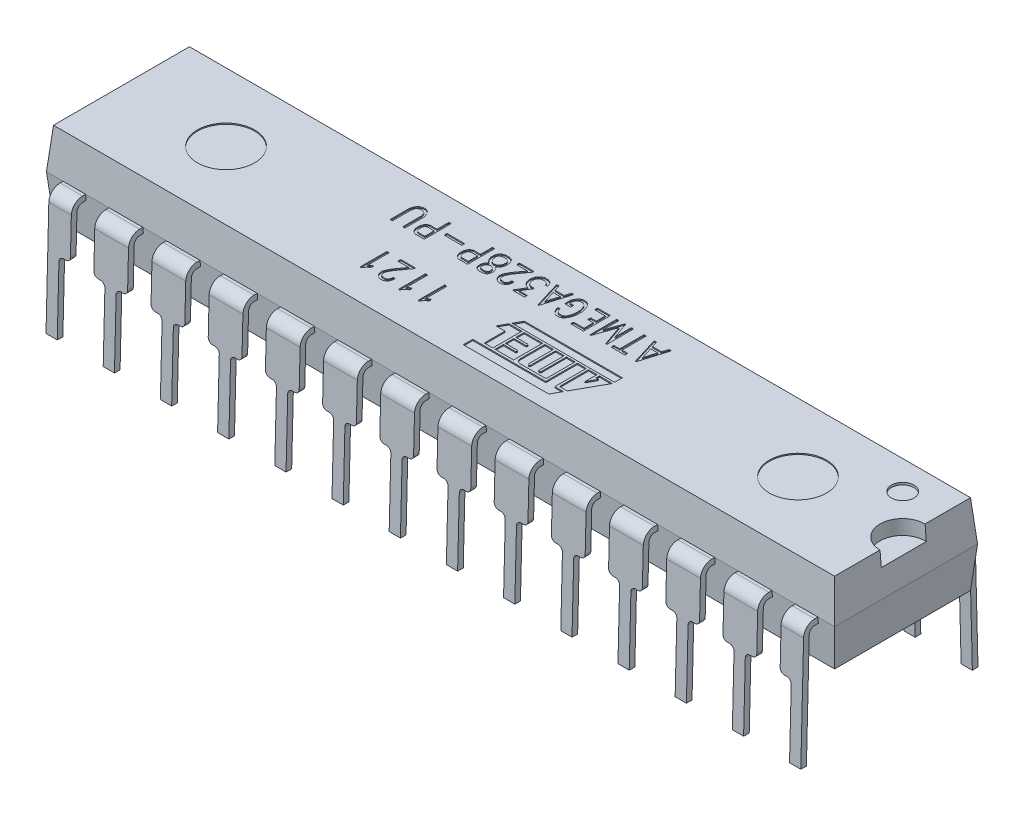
from build123d import *

# Parameters (mm, degrees)
EXTRUDE_THIN1_DEPTH     = 16.76
CUT_EXTRUDE1_DEPTH      = 18.508115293
CUT_EXTRUDE1_DEPTH_BACK = 18.508115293
BOSS_EXTRUDE1_DEPTH     = 17.5
CUT_EXTRUDE2_DEPTH      = 19.395125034
CUT_EXTRUDE2_DEPTH_BACK = 19.395125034
SKETCH5_R               = 1
CUT_EXTRUDE3_DEPTH      = 0.65
CUT_EXTRUDE4_DEPTH      = 0.05
CUT_EXTRUDE5_DEPTH      = 0.05
SKETCH9_R               = 1.27
CUT_EXTRUDE6_DEPTH      = 0.05
SKETCH10_R              = 0.5
CUT_EXTRUDE7_DEPTH      = 0.1


with BuildPart() as part:
    # Sketch1 → Extrude-Thin1 (new, symmetric)
    with BuildSketch(Plane(origin=(0, 0, 0), x_dir=(0, 0, -1), z_dir=(1, 0, 0))):
        with BuildLine():
            Line((-3.935, -3.18), (-3.81, 1.807527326))
            ThreePointArc((-3.81, 1.807527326), (-3.659253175, 2.152955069), (-3.310156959, 2.295))
            Line((-3.310156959, 2.295), (3.310156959, 2.295))
            ThreePointArc((3.310156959, 2.295), (3.659253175, 2.152955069), (3.81, 1.807527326))
            Line((3.81, 1.807527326), (3.935, -3.18))
            Line((3.935, -3.18), (3.685078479, -3.186263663))
            Line((3.685078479, -3.186263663), (3.560078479, 1.801263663))
            ThreePointArc((3.560078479, 1.801263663), (3.484705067, 1.973977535), (3.310156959, 2.045))
            Line((3.310156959, 2.045), (-3.310156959, 2.045))
            ThreePointArc((-3.310156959, 2.045), (-3.484705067, 1.973977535), (-3.560078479, 1.801263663))
            Line((-3.560078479, 1.801263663), (-3.685078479, -3.186263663))
            Line((-3.685078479, -3.186263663), (-3.935, -3.18))
        make_face()
    extrude(amount=EXTRUDE_THIN1_DEPTH, both=True)

    # Sketch2 → Cut-Extrude1 (cut, two sides: drawn at the far end of the back side and taken through both)
    with BuildSketch(Plane.XY.offset(-CUT_EXTRUDE1_DEPTH_BACK)):
        with BuildLine():
            Line((-3.56, -3.5), (-3.56, -0.2))
            ThreePointArc((-3.56, -0.2), (-3.501421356, -0.058578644), (-3.36, 0))
            Line((-3.36, 0), (-3.26, 0))
            ThreePointArc((-3.26, 0), (-3.118578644, 0.058578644), (-3.06, 0.2))
            Line((-3.06, 0.2), (-3.06, 2.295))
            Line((-3.06, 2.295), (-2.02, 2.295))
            Line((-2.02, 2.295), (-2.02, 0.2))
            ThreePointArc((-2.02, 0.2), (-1.961421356, 0.058578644), (-1.82, 0))
            Line((-1.82, 0), (-1.72, 0))
            ThreePointArc((-1.72, 0), (-1.578578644, -0.058578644), (-1.52, -0.2))
            Line((-1.52, -0.2), (-1.52, -3.5))
            Line((-1.52, -3.5), (-3.56, -3.5))
        make_face()
        with BuildLine():
            Line((-6.1, -3.5), (-6.1, -0.2))
            ThreePointArc((-6.1, -0.2), (-6.041421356, -0.058578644), (-5.9, 0))
            Line((-5.9, 0), (-5.8, 0))
            ThreePointArc((-5.8, 0), (-5.658578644, 0.058578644), (-5.6, 0.2))
            Line((-5.6, 0.2), (-5.6, 2.295))
            Line((-5.6, 2.295), (-4.56, 2.295))
            Line((-4.56, 2.295), (-4.56, 0.2))
            ThreePointArc((-4.56, 0.2), (-4.501421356, 0.058578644), (-4.36, 0))
            Line((-4.36, 0), (-4.26, 0))
            ThreePointArc((-4.26, 0), (-4.118578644, -0.058578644), (-4.06, -0.2))
            Line((-4.06, -0.2), (-4.06, -3.5))
            Line((-4.06, -3.5), (-6.1, -3.5))
        make_face()
        with BuildLine():
            Line((-1.02, -3.5), (-1.02, -0.2))
            ThreePointArc((-1.02, -0.2), (-0.961421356, -0.058578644), (-0.82, 0))
            Line((-0.82, 0), (-0.72, 0))
            ThreePointArc((-0.72, 0), (-0.578578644, 0.058578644), (-0.52, 0.2))
            Line((-0.52, 0.2), (-0.52, 2.295))
            Line((-0.52, 2.295), (0.52, 2.295))
            Line((0.52, 2.295), (0.52, 0.2))
            ThreePointArc((0.52, 0.2), (0.578578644, 0.058578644), (0.72, 0))
            Line((0.72, 0), (0.82, 0))
            ThreePointArc((0.82, 0), (0.961421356, -0.058578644), (1.02, -0.2))
            Line((1.02, -0.2), (1.02, -3.5))
            Line((1.02, -3.5), (-1.02, -3.5))
        make_face()
        with BuildLine():
            Line((1.52, -3.5), (1.52, -0.2))
            ThreePointArc((1.52, -0.2), (1.578578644, -0.058578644), (1.72, 0))
            Line((1.72, 0), (1.82, 0))
            ThreePointArc((1.82, 0), (1.961421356, 0.058578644), (2.02, 0.2))
            Line((2.02, 0.2), (2.02, 2.295))
            Line((2.02, 2.295), (3.06, 2.295))
            Line((3.06, 2.295), (3.06, 0.2))
            ThreePointArc((3.06, 0.2), (3.118578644, 0.058578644), (3.26, 0))
            Line((3.26, 0), (3.36, 0))
            ThreePointArc((3.36, 0), (3.501421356, -0.058578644), (3.56, -0.2))
            Line((3.56, -0.2), (3.56, -3.5))
            Line((3.56, -3.5), (1.52, -3.5))
        make_face()
        with BuildLine():
            Line((-8.64, -3.5), (-8.64, -0.2))
            ThreePointArc((-8.64, -0.2), (-8.581421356, -0.058578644), (-8.44, 0))
            Line((-8.44, 0), (-8.34, 0))
            ThreePointArc((-8.34, 0), (-8.198578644, 0.058578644), (-8.14, 0.2))
            Line((-8.14, 0.2), (-8.14, 2.295))
            Line((-8.14, 2.295), (-7.1, 2.295))
            Line((-7.1, 2.295), (-7.1, 0.2))
            ThreePointArc((-7.1, 0.2), (-7.041421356, 0.058578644), (-6.9, 0))
            Line((-6.9, 0), (-6.8, 0))
            ThreePointArc((-6.8, 0), (-6.658578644, -0.058578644), (-6.6, -0.2))
            Line((-6.6, -0.2), (-6.6, -3.5))
            Line((-6.6, -3.5), (-8.64, -3.5))
        make_face()
        with BuildLine():
            Line((-11.18, -3.5), (-11.18, -0.2))
            ThreePointArc((-11.18, -0.2), (-11.121421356, -0.058578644), (-10.98, 0))
            Line((-10.98, 0), (-10.88, 0))
            ThreePointArc((-10.88, 0), (-10.738578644, 0.058578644), (-10.68, 0.2))
            Line((-10.68, 0.2), (-10.68, 2.295))
            Line((-10.68, 2.295), (-9.64, 2.295))
            Line((-9.64, 2.295), (-9.64, 0.2))
            ThreePointArc((-9.64, 0.2), (-9.581421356, 0.058578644), (-9.44, 0))
            Line((-9.44, 0), (-9.34, 0))
            ThreePointArc((-9.34, 0), (-9.198578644, -0.058578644), (-9.14, -0.2))
            Line((-9.14, -0.2), (-9.14, -3.5))
            Line((-9.14, -3.5), (-11.18, -3.5))
        make_face()
        with BuildLine():
            Line((-13.72, -3.5), (-13.72, -0.2))
            ThreePointArc((-13.72, -0.2), (-13.661421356, -0.058578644), (-13.52, 0))
            Line((-13.52, 0), (-13.42, 0))
            ThreePointArc((-13.42, 0), (-13.278578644, 0.058578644), (-13.22, 0.2))
            Line((-13.22, 0.2), (-13.22, 2.295))
            Line((-13.22, 2.295), (-12.18, 2.295))
            Line((-12.18, 2.295), (-12.18, 0.2))
            ThreePointArc((-12.18, 0.2), (-12.121421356, 0.058578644), (-11.98, 0))
            Line((-11.98, 0), (-11.88, 0))
            ThreePointArc((-11.88, 0), (-11.738578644, -0.058578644), (-11.68, -0.2))
            Line((-11.68, -0.2), (-11.68, -3.5))
            Line((-11.68, -3.5), (-13.72, -3.5))
        make_face()
        with BuildLine():
            Line((-16.26, -3.5), (-16.26, -0.2))
            ThreePointArc((-16.26, -0.2), (-16.201421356, -0.058578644), (-16.06, 0))
            Line((-16.06, 0), (-15.96, 0))
            ThreePointArc((-15.96, 0), (-15.818578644, 0.058578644), (-15.76, 0.2))
            Line((-15.76, 0.2), (-15.76, 2.295))
            Line((-15.76, 2.295), (-14.72, 2.295))
            Line((-14.72, 2.295), (-14.72, 0.2))
            ThreePointArc((-14.72, 0.2), (-14.661421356, 0.058578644), (-14.52, 0))
            Line((-14.52, 0), (-14.42, 0))
            ThreePointArc((-14.42, 0), (-14.278578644, -0.058578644), (-14.22, -0.2))
            Line((-14.22, -0.2), (-14.22, -3.5))
            Line((-14.22, -3.5), (-16.26, -3.5))
        make_face()
        with BuildLine():
            Line((4.06, -3.5), (4.06, -0.2))
            ThreePointArc((4.06, -0.2), (4.118578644, -0.058578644), (4.26, 0))
            Line((4.26, 0), (4.36, 0))
            ThreePointArc((4.36, 0), (4.501421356, 0.058578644), (4.56, 0.2))
            Line((4.56, 0.2), (4.56, 2.295))
            Line((4.56, 2.295), (5.6, 2.295))
            Line((5.6, 2.295), (5.6, 0.2))
            ThreePointArc((5.6, 0.2), (5.658578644, 0.058578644), (5.8, 0))
            Line((5.8, 0), (5.9, 0))
            ThreePointArc((5.9, 0), (6.041421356, -0.058578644), (6.1, -0.2))
            Line((6.1, -0.2), (6.1, -3.5))
            Line((6.1, -3.5), (4.06, -3.5))
        make_face()
        with BuildLine():
            Line((6.6, -3.5), (6.6, -0.2))
            ThreePointArc((6.6, -0.2), (6.658578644, -0.058578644), (6.8, 0))
            Line((6.8, 0), (6.9, 0))
            ThreePointArc((6.9, 0), (7.041421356, 0.058578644), (7.1, 0.2))
            Line((7.1, 0.2), (7.1, 2.295))
            Line((7.1, 2.295), (8.14, 2.295))
            Line((8.14, 2.295), (8.14, 0.2))
            ThreePointArc((8.14, 0.2), (8.198578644, 0.058578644), (8.34, 0))
            Line((8.34, 0), (8.44, 0))
            ThreePointArc((8.44, 0), (8.581421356, -0.058578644), (8.64, -0.2))
            Line((8.64, -0.2), (8.64, -3.5))
            Line((8.64, -3.5), (6.6, -3.5))
        make_face()
        with BuildLine():
            Line((9.14, -3.5), (9.14, -0.2))
            ThreePointArc((9.14, -0.2), (9.198578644, -0.058578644), (9.34, 0))
            Line((9.34, 0), (9.44, 0))
            ThreePointArc((9.44, 0), (9.581421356, 0.058578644), (9.64, 0.2))
            Line((9.64, 0.2), (9.64, 2.295))
            Line((9.64, 2.295), (10.68, 2.295))
            Line((10.68, 2.295), (10.68, 0.2))
            ThreePointArc((10.68, 0.2), (10.738578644, 0.058578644), (10.88, 0))
            Line((10.88, 0), (10.98, 0))
            ThreePointArc((10.98, 0), (11.121421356, -0.058578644), (11.18, -0.2))
            Line((11.18, -0.2), (11.18, -3.5))
            Line((11.18, -3.5), (9.14, -3.5))
        make_face()
        with BuildLine():
            Line((11.68, -3.5), (11.68, -0.2))
            ThreePointArc((11.68, -0.2), (11.738578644, -0.058578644), (11.88, 0))
            Line((11.88, 0), (11.98, 0))
            ThreePointArc((11.98, 0), (12.121421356, 0.058578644), (12.18, 0.2))
            Line((12.18, 0.2), (12.18, 2.295))
            Line((12.18, 2.295), (13.22, 2.295))
            Line((13.22, 2.295), (13.22, 0.2))
            ThreePointArc((13.22, 0.2), (13.278578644, 0.058578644), (13.42, 0))
            Line((13.42, 0), (13.52, 0))
            ThreePointArc((13.52, 0), (13.661421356, -0.058578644), (13.72, -0.2))
            Line((13.72, -0.2), (13.72, -3.5))
            Line((13.72, -3.5), (11.68, -3.5))
        make_face()
        with BuildLine():
            Line((14.22, -3.5), (14.22, -0.2))
            ThreePointArc((14.22, -0.2), (14.278578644, -0.058578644), (14.42, 0))
            Line((14.42, 0), (14.52, 0))
            ThreePointArc((14.52, 0), (14.661421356, 0.058578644), (14.72, 0.2))
            Line((14.72, 0.2), (14.72, 2.295))
            Line((14.72, 2.295), (15.76, 2.295))
            Line((15.76, 2.295), (15.76, 0.2))
            ThreePointArc((15.76, 0.2), (15.818578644, 0.058578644), (15.96, 0))
            Line((15.96, 0), (16.06, 0))
            ThreePointArc((16.06, 0), (16.201421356, -0.058578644), (16.26, -0.2))
            Line((16.26, -0.2), (16.26, -3.5))
            Line((16.26, -3.5), (14.22, -3.5))
        make_face()
    extrude(amount=CUT_EXTRUDE1_DEPTH + CUT_EXTRUDE1_DEPTH_BACK, mode=Mode.SUBTRACT)


with BuildPart() as cut_extrude1_piece_1:
    # of the separate pieces the step leaves, piece 1, a body of its own (cut_extrude1_pieces)
    add(part.part.solids().sort_by_distance((13.22, 2.045, 3.310156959))[0])


with BuildPart() as cut_extrude1_piece_2:
    # of the separate pieces the step leaves, piece 2, a body of its own (cut_extrude1_pieces)
    add(part.part.solids().sort_by_distance((-2.02, 2.045, 3.310156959))[0])



with BuildPart() as cut_extrude1_piece_3:
    # of the separate pieces the step leaves, piece 3, a body of its own (cut_extrude1_pieces)
    add(part.part.solids().sort_by_distance((10.68, 2.045, 3.310156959))[0])


with BuildPart() as cut_extrude1_piece_4:
    # of the separate pieces the step leaves, piece 4, a body of its own (cut_extrude1_pieces)
    add(part.part.solids().sort_by_distance((0.52, 2.045, 3.310156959))[0])


with BuildPart() as cut_extrude1_piece_5:
    # of the separate pieces the step leaves, piece 5, a body of its own (cut_extrude1_pieces)
    add(part.part.solids().sort_by_distance((-4.56, 2.045, 3.310156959))[0])


with BuildPart() as cut_extrude1_piece_6:
    # of the separate pieces the step leaves, piece 6, a body of its own (cut_extrude1_pieces)
    add(part.part.solids().sort_by_distance((3.06, 2.045, 3.310156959))[0])


with BuildPart() as cut_extrude1_piece_7:
    # of the separate pieces the step leaves, piece 7, a body of its own (cut_extrude1_pieces)
    add(part.part.solids().sort_by_distance((5.6, 2.045, 3.310156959))[0])


with BuildPart() as cut_extrude1_piece_8:
    # of the separate pieces the step leaves, piece 8, a body of its own (cut_extrude1_pieces)
    add(part.part.solids().sort_by_distance((8.14, 2.045, 3.310156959))[0])


with BuildPart() as cut_extrude1_piece_9:
    # of the separate pieces the step leaves, piece 9, a body of its own (cut_extrude1_pieces)
    add(part.part.solids().sort_by_distance((-7.1, 2.045, 3.310156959))[0])


with BuildPart() as cut_extrude1_piece_10:
    # of the separate pieces the step leaves, piece 10, a body of its own (cut_extrude1_pieces)
    add(part.part.solids().sort_by_distance((-9.64, 2.045, 3.310156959))[0])


with BuildPart() as cut_extrude1_piece_11:
    # of the separate pieces the step leaves, piece 11, a body of its own (cut_extrude1_pieces)
    add(part.part.solids().sort_by_distance((-12.18, 2.045, 3.310156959))[0])


with BuildPart() as cut_extrude1_piece_12:
    # of the separate pieces the step leaves, piece 12, a body of its own (cut_extrude1_pieces)
    add(part.part.solids().sort_by_distance((-14.72, 2.045, 3.310156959))[0])


with BuildPart() as cut_extrude1_piece_13:
    # of the separate pieces the step leaves, piece 13, a body of its own (cut_extrude1_pieces)
    add(part.part.solids().sort_by_distance((15.76, 2.045, 3.310156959))[0])


with BuildPart() as cut_extrude1_piece_14:
    # of the separate pieces the step leaves, piece 14, a body of its own (cut_extrude1_pieces)
    add(part.part.solids().sort_by_distance((-16.76, 2.045, 3.310156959))[0])


with BuildPart() as cut_extrude1_piece_2_1:
    add(cut_extrude1_piece_2.part)

    add(cut_extrude1_piece_4.part)  # Boss-Extrude1 merges Cut-Extrude1 piece 4

    add(cut_extrude1_piece_5.part)  # Boss-Extrude1 merges Cut-Extrude1 piece 5

    add(cut_extrude1_piece_6.part)  # Boss-Extrude1 merges Cut-Extrude1 piece 6
    # Sketch3 → Boss-Extrude1 (add, symmetric)
    with BuildSketch(Plane(origin=(0, 0, 0), x_dir=(0, 0, -1), z_dir=(1, 0, 0))):
        Polygon((-3.018832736, 4.08), (3.018832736, 4.08), (3.175, 2.295), (3.018832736, 0.51), (-3.018832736, 0.51), (-3.175, 2.295), align=None)
    extrude(amount=BOSS_EXTRUDE1_DEPTH, both=True)

    # Sketch4 → Cut-Extrude2 (cut, two sides: drawn at the far end of the back side and taken through both)
    with BuildSketch(Plane.XY.offset(-CUT_EXTRUDE2_DEPTH_BACK)):
        Polygon((-17.343832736, 4.08), (-17.5, 2.295), (-17.343832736, 0.51), (-20, 0.51), (-20, 4.08), align=None)
        Polygon((17.5, 2.295), (17.343832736, 4.08), (20, 4.08), (20, 0.51), (17.343832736, 0.51), align=None)
    extrude(amount=CUT_EXTRUDE2_DEPTH + CUT_EXTRUDE2_DEPTH_BACK, mode=Mode.SUBTRACT)

    # Sketch5 → Cut-Extrude3 (cut)
    with BuildSketch(Plane(origin=(0, 4.08, 0), x_dir=(1, 0, 0), z_dir=(0, 1, 0))):
        with Locations((17.343832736, 0)):
            Circle(SKETCH5_R)
    extrude(amount=-CUT_EXTRUDE3_DEPTH, mode=Mode.SUBTRACT)

    # Sketch6 → Cut-Extrude4 (cut)
    with BuildSketch(Plane(origin=(0, 4.08, 0), x_dir=(1, 0, 0), z_dir=(0, 1, 0))):
        Polygon((3.44, -0.54), (3.84, -0.54), (3.84, -1.94), (4.223967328, -1.94), (3.991157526, -2.36), (0.2, -2.36), (0.2, -1.94), (3.44, -1.94), align=None)
        with BuildLine():
            ThreePointArc((2.86, -1.67), (2.865857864, -1.684142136), (2.88, -1.69))
            Line((2.88, -1.69), (2.94, -1.69))
            ThreePointArc((2.94, -1.69), (2.954142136, -1.684142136), (2.96, -1.67))
            Line((2.96, -1.67), (2.96, -0.54))
            Line((2.96, -0.54), (3.34, -0.54))
            Line((3.34, -0.54), (3.34, -1.83))
            Line((3.34, -1.83), (2.2, -1.83))
            ThreePointArc((2.2, -1.83), (2.058578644, -1.771421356), (2, -1.63))
            Line((2, -1.63), (2, -0.54))
            Line((2, -0.54), (2.38, -0.54))
            Line((2.38, -0.54), (2.38, -1.63))
            ThreePointArc((2.38, -1.63), (2.397573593, -1.672426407), (2.44, -1.69))
            Line((2.44, -1.69), (2.48, -1.69))
            Line((2.48, -1.69), (2.48, -0.54))
            Line((2.48, -0.54), (2.86, -0.54))
            Line((2.86, -0.54), (2.86, -1.67))
        make_face()
        Polygon((4.42, -0.54), (5, -0.54), (4.284941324, -1.83), (3.94, -1.83), (3.94, -0.54), (4.32, -0.54), (4.32, -1.068850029), (4.53, -0.69), (4.42, -0.69), align=None)
        with BuildLine():
            Line((1.08, -0.54), (1.08, -0.91))
            Line((1.08, -0.91), (1.61, -0.91))
            ThreePointArc((1.61, -0.91), (1.631213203, -0.918786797), (1.64, -0.94))
            Line((1.64, -0.94), (1.64, -0.97))
            ThreePointArc((1.64, -0.97), (1.631213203, -0.991213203), (1.61, -1))
            Line((1.61, -1), (1.08, -1))
            Line((1.08, -1), (1.08, -1.37))
            Line((1.08, -1.37), (1.61, -1.37))
            ThreePointArc((1.61, -1.37), (1.631213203, -1.378786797), (1.64, -1.4))
            Line((1.64, -1.4), (1.64, -1.43))
            ThreePointArc((1.64, -1.43), (1.631213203, -1.451213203), (1.61, -1.46))
            Line((1.61, -1.46), (1.08, -1.46))
            Line((1.08, -1.46), (1.08, -1.83))
            Line((1.08, -1.83), (1.9, -1.83))
            Line((1.9, -1.83), (1.9, -0.54))
            Line((1.9, -0.54), (1.08, -0.54))
        make_face()
        Polygon((0.98, -1.83), (0.6, -1.83), (0.6, -0.91), (0.2, -0.91), (0.405094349, -0.54), (0.98, -0.54), align=None)
        Polygon((0.648990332, -0.1), (5, -0.1), (5, -0.45), (0.454982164, -0.45), align=None)
    extrude(amount=-CUT_EXTRUDE4_DEPTH, mode=Mode.SUBTRACT)

    # Sketch8 → Cut-Extrude5 (cut)
    # profile 1 of 17: a face of its own
    with BuildSketch(Plane(origin=(0, 4.08, 0), x_dir=(1, 0, 0), z_dir=(0, 1, 0))):
        with BuildLine():
            add(Edge.make_bspline(
                [(-2.504464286, -1.6609375), (-2.507326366, -1.656915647), (-2.513395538, -1.648387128), (-2.513977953, -1.637905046), (-2.514285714, -1.632366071)],
                knots=[0, 0, 0, 0, 0.943153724, 2, 2, 2, 2], degree=3))
            Line((-2.514285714, -1.632366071), (-2.514285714, -0.494196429))
            add(Edge.make_bspline(
                [(-2.514285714, -0.494196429), (-2.512660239, -0.489242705), (-2.509578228, -0.479850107), (-2.501558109, -0.474131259), (-2.497767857, -0.471428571)],
                knots=[0, 0, 0, 0, 1.05481425, 2, 2, 2, 2], degree=3))
            Line((-2.497767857, -0.471428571), (-2.432142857, -0.471428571))
            add(Edge.make_bspline(
                [(-2.432142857, -0.471428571), (-2.430000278, -0.472365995), (-2.425771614, -0.474216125), (-2.420409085, -0.478868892), (-2.416584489, -0.485150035), (-2.41507604, -0.48991447), (-2.414285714, -0.492410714)],
                knots=[0, 0, 0, 0, 0.972168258, 1.918702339, 2.909539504, 4, 4, 4, 4], degree=3))
            Line((-2.414285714, -0.492410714), (-2.414285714, -0.524776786))
            Line((-2.414285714, -0.524776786), (-2.414285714, -1.4390625))
            Line((-2.414285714, -1.4390625), (-2.370535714, -1.385267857))
            Line((-2.370535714, -1.385267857), (-2.276339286, -1.328348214))
            add(Edge.make_bspline(
                [(-2.276339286, -1.328348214), (-2.273506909, -1.328495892), (-2.268313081, -1.328766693), (-2.261030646, -1.330229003), (-2.255135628, -1.333171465), (-2.250024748, -1.337541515), (-2.2465584, -1.34506907), (-2.244517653, -1.355849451), (-2.242937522, -1.370567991), (-2.242886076, -1.381690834), (-2.242857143, -1.387946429)],
                knots=[0, 0, 0, 0, 0.853787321, 1.565619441, 2.216715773, 2.819394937, 3.550694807, 4.653687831, 6.118001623, 8, 8, 8, 8], degree=3))
            Line((-2.242857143, -1.387946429), (-2.242857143, -1.40625))
            add(Edge.make_bspline(
                [(-2.242857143, -1.40625), (-2.243000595, -1.411029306), (-2.243265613, -1.419858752), (-2.245805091, -1.431775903), (-2.250189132, -1.441428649), (-2.254906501, -1.445729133), (-2.257142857, -1.447767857)],
                knots=[0, 0, 0, 0, 1.260445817, 2.328588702, 3.207636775, 4, 4, 4, 4], degree=3))
            Line((-2.257142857, -1.447767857), (-2.340625, -1.500669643))
            Line((-2.340625, -1.500669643), (-2.472544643, -1.666517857))
            add(Edge.make_bspline(
                [(-2.472544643, -1.666517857), (-2.474180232, -1.667893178), (-2.477888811, -1.671011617), (-2.48276527, -1.671279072), (-2.485491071, -1.671428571)],
                knots=[0, 0, 0, 0, 0.882057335, 2, 2, 2, 2], degree=3))
            add(Edge.make_bspline(
                [(-2.485491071, -1.671428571), (-2.488749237, -1.670791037), (-2.496142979, -1.669344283), (-2.501479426, -1.66395302), (-2.504464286, -1.6609375)],
                knots=[0, 0, 0, 0, 0.881330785, 2, 2, 2, 2], degree=3))
        make_face()
    # profile 2 of 17: a face of its own
    with BuildSketch(Plane(origin=(0, 4.08, 0), x_dir=(1, 0, 0), z_dir=(0, 1, 0))):
        with BuildLine():
            add(Edge.make_bspline(
                [(-3.361607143, -1.6609375), (-3.364469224, -1.656915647), (-3.370538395, -1.648387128), (-3.37112081, -1.637905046), (-3.371428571, -1.632366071)],
                knots=[0, 0, 0, 0, 0.943153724, 2, 2, 2, 2], degree=3))
            Line((-3.371428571, -1.632366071), (-3.371428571, -0.494196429))
            add(Edge.make_bspline(
                [(-3.371428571, -0.494196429), (-3.369803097, -0.489242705), (-3.366721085, -0.479850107), (-3.358700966, -0.474131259), (-3.354910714, -0.471428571)],
                knots=[0, 0, 0, 0, 1.05481425, 2, 2, 2, 2], degree=3))
            Line((-3.354910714, -0.471428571), (-3.289285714, -0.471428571))
            add(Edge.make_bspline(
                [(-3.289285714, -0.471428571), (-3.287143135, -0.472365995), (-3.282914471, -0.474216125), (-3.277551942, -0.478868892), (-3.273727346, -0.485150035), (-3.272218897, -0.48991447), (-3.271428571, -0.492410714)],
                knots=[0, 0, 0, 0, 0.972168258, 1.918702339, 2.909539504, 4, 4, 4, 4], degree=3))
            Line((-3.271428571, -0.492410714), (-3.271428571, -0.524776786))
            Line((-3.271428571, -0.524776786), (-3.271428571, -1.4390625))
            Line((-3.271428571, -1.4390625), (-3.227678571, -1.385267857))
            Line((-3.227678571, -1.385267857), (-3.133482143, -1.328348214))
            add(Edge.make_bspline(
                [(-3.133482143, -1.328348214), (-3.130649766, -1.328495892), (-3.125455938, -1.328766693), (-3.118173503, -1.330229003), (-3.112278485, -1.333171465), (-3.107167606, -1.337541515), (-3.103701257, -1.34506907), (-3.10166051, -1.355849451), (-3.100080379, -1.370567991), (-3.100028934, -1.381690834), (-3.1, -1.387946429)],
                knots=[0, 0, 0, 0, 0.853787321, 1.565619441, 2.216715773, 2.819394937, 3.550694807, 4.653687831, 6.118001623, 8, 8, 8, 8], degree=3))
            Line((-3.1, -1.387946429), (-3.1, -1.40625))
            add(Edge.make_bspline(
                [(-3.1, -1.40625), (-3.100143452, -1.411029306), (-3.10040847, -1.419858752), (-3.102947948, -1.431775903), (-3.107331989, -1.441428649), (-3.112049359, -1.445729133), (-3.114285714, -1.447767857)],
                knots=[0, 0, 0, 0, 1.260445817, 2.328588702, 3.207636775, 4, 4, 4, 4], degree=3))
            Line((-3.114285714, -1.447767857), (-3.197767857, -1.500669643))
            Line((-3.197767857, -1.500669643), (-3.3296875, -1.666517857))
            add(Edge.make_bspline(
                [(-3.3296875, -1.666517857), (-3.331323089, -1.667893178), (-3.335031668, -1.671011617), (-3.339908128, -1.671279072), (-3.342633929, -1.671428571)],
                knots=[0, 0, 0, 0, 0.882057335, 2, 2, 2, 2], degree=3))
            add(Edge.make_bspline(
                [(-3.342633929, -1.671428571), (-3.345892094, -1.670791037), (-3.353285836, -1.669344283), (-3.358622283, -1.66395302), (-3.361607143, -1.6609375)],
                knots=[0, 0, 0, 0, 0.881330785, 2, 2, 2, 2], degree=3))
        make_face()
    # profile 3 of 17: a face of its own
    with BuildSketch(Plane(origin=(0, 4.08, 0), x_dir=(1, 0, 0), z_dir=(0, 1, 0))):
        with BuildLine():
            Line((-4.333482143, -1.608258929), (-4.383035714, -1.546875))
            Line((-4.383035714, -1.546875), (-4.428571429, -1.430357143))
            Line((-4.428571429, -1.430357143), (-4.428571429, -1.310491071))
            Line((-4.428571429, -1.310491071), (-4.425892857, -1.297544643))
            Line((-4.425892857, -1.297544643), (-4.380357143, -1.1875))
            Line((-4.380357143, -1.1875), (-4.293080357, -1.025669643))
            Line((-4.293080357, -1.025669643), (-3.984151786, -0.6))
            Line((-3.984151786, -0.6), (-4.452232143, -0.6))
            add(Edge.make_bspline(
                [(-4.452232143, -0.6), (-4.454994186, -0.597920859), (-4.460715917, -0.5936138), (-4.466607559, -0.5835898), (-4.469810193, -0.570883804), (-4.470135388, -0.561554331), (-4.4703125, -0.556473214)],
                knots=[0, 0, 0, 0, 0.835533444, 1.730855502, 2.764154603, 4, 4, 4, 4], degree=3))
            add(Edge.make_bspline(
                [(-4.4703125, -0.556473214), (-4.470171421, -0.554017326), (-4.469807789, -0.547687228), (-4.469290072, -0.541367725), (-4.468973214, -0.5375)],
                knots=[0, 0, 0, 0, 0.775940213, 2, 2, 2, 2], degree=3))
            add(Edge.make_bspline(
                [(-4.468973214, -0.5375), (-4.468633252, -0.532440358), (-4.467968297, -0.522543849), (-4.468643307, -0.512648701), (-4.468973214, -0.5078125)],
                knots=[0, 0, 0, 0, 1.022510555, 2, 2, 2, 2], degree=3))
            add(Edge.make_bspline(
                [(-4.468973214, -0.5078125), (-4.468815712, -0.504293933), (-4.46851969, -0.497680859), (-4.46596601, -0.488525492), (-4.462123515, -0.480624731), (-4.458014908, -0.476834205), (-4.456026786, -0.475)],
                knots=[0, 0, 0, 0, 1.156160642, 2.172979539, 3.115919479, 4, 4, 4, 4], degree=3))
            Line((-4.456026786, -0.475), (-4.448214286, -0.471428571))
            Line((-4.448214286, -0.471428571), (-3.833705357, -0.471428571))
            add(Edge.make_bspline(
                [(-3.833705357, -0.471428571), (-3.831042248, -0.472495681), (-3.825749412, -0.474616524), (-3.819836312, -0.481726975), (-3.815904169, -0.49109608), (-3.81485447, -0.498318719), (-3.814285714, -0.502232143)],
                knots=[0, 0, 0, 0, 0.877497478, 1.743995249, 2.777634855, 4, 4, 4, 4], degree=3))
            add(Edge.make_bspline(
                [(-3.814285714, -0.502232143), (-3.814576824, -0.507327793), (-3.815133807, -0.517077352), (-3.819847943, -0.525613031), (-3.822098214, -0.5296875)],
                knots=[0, 0, 0, 0, 1.045308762, 2, 2, 2, 2], degree=3))
            Line((-3.822098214, -0.5296875), (-4.210714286, -1.0703125))
            add(Edge.make_bspline(
                [(-4.210714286, -1.0703125), (-4.221502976, -1.090252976), (-4.243080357, -1.130133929), (-4.264657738, -1.170014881), (-4.275446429, -1.189955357)],
                knots=[0, 0, 0, 0, 1, 2, 2, 2, 2], degree=3))
            add(Edge.make_bspline(
                [(-4.275446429, -1.189955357), (-4.28136974, -1.201655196), (-4.292696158, -1.224027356), (-4.307057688, -1.256998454), (-4.319468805, -1.287208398), (-4.325646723, -1.306949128), (-4.328571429, -1.316294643)],
                knots=[0, 0, 0, 0, 1.146390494, 2.192101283, 3.14411757, 4, 4, 4, 4], degree=3))
            Line((-4.328571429, -1.316294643), (-4.328571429, -1.408482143))
            Line((-4.328571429, -1.408482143), (-4.292410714, -1.499107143))
            Line((-4.292410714, -1.499107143), (-4.219866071, -1.542857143))
            Line((-4.219866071, -1.542857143), (-4.061830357, -1.542857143))
            Line((-4.061830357, -1.542857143), (-3.989285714, -1.495758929))
            Line((-3.989285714, -1.495758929), (-3.955580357, -1.4046875))
            Line((-3.955580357, -1.4046875), (-3.955580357, -1.367410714))
            add(Edge.make_bspline(
                [(-3.955580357, -1.367410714), (-3.955396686, -1.362916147), (-3.955057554, -1.354617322), (-3.951869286, -1.343374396), (-3.946907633, -1.333983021), (-3.941474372, -1.330188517), (-3.938839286, -1.328348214)],
                knots=[0, 0, 0, 0, 1.209701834, 2.233608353, 3.143314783, 4, 4, 4, 4], degree=3))
            add(Edge.make_bspline(
                [(-3.938839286, -1.328348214), (-3.935122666, -1.327920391), (-3.926448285, -1.326921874), (-3.917714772, -1.326835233), (-3.912723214, -1.326785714)],
                knots=[0, 0, 0, 0, 0.856918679, 2, 2, 2, 2], degree=3))
            add(Edge.make_bspline(
                [(-3.912723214, -1.326785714), (-3.905574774, -1.32681883), (-3.893498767, -1.326874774), (-3.881470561, -1.327921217), (-3.8765625, -1.328348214)],
                knots=[0, 0, 0, 0, 1.183907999, 2, 2, 2, 2], degree=3))
            add(Edge.make_bspline(
                [(-3.8765625, -1.328348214), (-3.873325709, -1.329810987), (-3.866797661, -1.332761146), (-3.859957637, -1.34237685), (-3.856459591, -1.355109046), (-3.856036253, -1.364631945), (-3.855803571, -1.369866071)],
                knots=[0, 0, 0, 0, 0.844617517, 1.703447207, 2.737732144, 4, 4, 4, 4], degree=3))
            add(Edge.make_bspline(
                [(-3.855803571, -1.369866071), (-3.855522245, -1.371947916), (-3.854700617, -1.378028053), (-3.85536601, -1.384146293), (-3.855803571, -1.388169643)],
                knots=[0, 0, 0, 0, 0.68480177, 2, 2, 2, 2], degree=3))
            add(Edge.make_bspline(
                [(-3.855803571, -1.388169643), (-3.85613864, -1.393078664), (-3.856813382, -1.402964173), (-3.857032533, -1.412870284), (-3.857142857, -1.417857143)],
                knots=[0, 0, 0, 0, 0.993175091, 2, 2, 2, 2], degree=3))
            Line((-3.857142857, -1.417857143), (-3.859598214, -1.4328125))
            Line((-3.859598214, -1.4328125), (-3.904017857, -1.545535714))
            Line((-3.904017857, -1.545535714), (-3.958705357, -1.613392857))
            add(Edge.make_bspline(
                [(-3.958705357, -1.613392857), (-3.964557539, -1.617155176), (-3.977623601, -1.625555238), (-3.999894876, -1.638420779), (-4.025805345, -1.654511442), (-4.044760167, -1.665528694), (-4.054910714, -1.671428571)],
                knots=[0, 0, 0, 0, 0.742919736, 1.658703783, 2.746206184, 4, 4, 4, 4], degree=3))
            Line((-4.054910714, -1.671428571), (-4.237276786, -1.669866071))
            Line((-4.237276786, -1.669866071), (-4.333482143, -1.608258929))
        make_face()
    # profile 4 of 17: a face of its own
    with BuildSketch(Plane(origin=(0, 4.08, 0), x_dir=(1, 0, 0), z_dir=(0, 1, 0))):
        with BuildLine():
            add(Edge.make_bspline(
                [(-5.075892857, -1.6609375), (-5.078754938, -1.656915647), (-5.084824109, -1.648387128), (-5.085406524, -1.637905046), (-5.085714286, -1.632366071)],
                knots=[0, 0, 0, 0, 0.943153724, 2, 2, 2, 2], degree=3))
            Line((-5.085714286, -1.632366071), (-5.085714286, -0.494196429))
            add(Edge.make_bspline(
                [(-5.085714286, -0.494196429), (-5.084088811, -0.489242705), (-5.0810068, -0.479850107), (-5.07298668, -0.474131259), (-5.069196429, -0.471428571)],
                knots=[0, 0, 0, 0, 1.05481425, 2, 2, 2, 2], degree=3))
            Line((-5.069196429, -0.471428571), (-5.003571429, -0.471428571))
            add(Edge.make_bspline(
                [(-5.003571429, -0.471428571), (-5.001428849, -0.472365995), (-4.997200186, -0.474216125), (-4.991837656, -0.478868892), (-4.98801306, -0.485150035), (-4.986504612, -0.48991447), (-4.985714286, -0.492410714)],
                knots=[0, 0, 0, 0, 0.972168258, 1.918702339, 2.909539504, 4, 4, 4, 4], degree=3))
            Line((-4.985714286, -0.492410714), (-4.985714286, -0.524776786))
            Line((-4.985714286, -0.524776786), (-4.985714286, -1.4390625))
            Line((-4.985714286, -1.4390625), (-4.941964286, -1.385267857))
            Line((-4.941964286, -1.385267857), (-4.847767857, -1.328348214))
            add(Edge.make_bspline(
                [(-4.847767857, -1.328348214), (-4.84493548, -1.328495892), (-4.839741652, -1.328766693), (-4.832459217, -1.330229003), (-4.826564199, -1.333171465), (-4.82145332, -1.337541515), (-4.817986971, -1.34506907), (-4.815946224, -1.355849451), (-4.814366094, -1.370567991), (-4.814314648, -1.381690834), (-4.814285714, -1.387946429)],
                knots=[0, 0, 0, 0, 0.853787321, 1.565619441, 2.216715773, 2.819394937, 3.550694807, 4.653687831, 6.118001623, 8, 8, 8, 8], degree=3))
            Line((-4.814285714, -1.387946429), (-4.814285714, -1.40625))
            add(Edge.make_bspline(
                [(-4.814285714, -1.40625), (-4.814429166, -1.411029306), (-4.814694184, -1.419858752), (-4.817233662, -1.431775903), (-4.821617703, -1.441428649), (-4.826335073, -1.445729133), (-4.828571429, -1.447767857)],
                knots=[0, 0, 0, 0, 1.260445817, 2.328588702, 3.207636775, 4, 4, 4, 4], degree=3))
            Line((-4.828571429, -1.447767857), (-4.912053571, -1.500669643))
            Line((-4.912053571, -1.500669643), (-5.043973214, -1.666517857))
            add(Edge.make_bspline(
                [(-5.043973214, -1.666517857), (-5.045608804, -1.667893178), (-5.049317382, -1.671011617), (-5.054193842, -1.671279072), (-5.056919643, -1.671428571)],
                knots=[0, 0, 0, 0, 0.882057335, 2, 2, 2, 2], degree=3))
            add(Edge.make_bspline(
                [(-5.056919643, -1.671428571), (-5.060177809, -1.670791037), (-5.06757155, -1.669344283), (-5.072907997, -1.66395302), (-5.075892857, -1.6609375)],
                knots=[0, 0, 0, 0, 0.881330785, 2, 2, 2, 2], degree=3))
        make_face()
    # profile 5 of 17: a face of its own
    with BuildSketch(Plane(origin=(0, 4.08, 0), x_dir=(1, 0, 0), z_dir=(0, 1, 0))):
        with BuildLine():
            Line((4.644866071, 0.849776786), (4.3, 1.989508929))
            add(Edge.make_bspline(
                [(4.3, 1.989508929), (4.300067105, 1.99278939), (4.300191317, 1.998861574), (4.301540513, 2.007264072), (4.303592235, 2.014229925), (4.306903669, 2.019822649), (4.31157556, 2.024098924), (4.318042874, 2.026654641), (4.325934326, 2.028522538), (4.331830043, 2.028554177), (4.335044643, 2.028571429)],
                knots=[0, 0, 0, 0, 1.274690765, 2.359471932, 3.302146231, 4.081389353, 4.860094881, 5.715183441, 6.754219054, 8, 8, 8, 8], degree=3))
            Line((4.335044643, 2.028571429), (4.378125, 2.028571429))
            add(Edge.make_bspline(
                [(4.378125, 2.028571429), (4.381467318, 2.026554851), (4.388528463, 2.022294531), (4.392679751, 2.01514782), (4.394866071, 2.011383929)],
                knots=[0, 0, 0, 0, 0.946678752, 2, 2, 2, 2], degree=3))
            Line((4.394866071, 2.011383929), (4.471651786, 1.771428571))
            Line((4.471651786, 1.771428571), (4.869866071, 1.771428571))
            Line((4.869866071, 1.771428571), (4.949107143, 2.014732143))
            add(Edge.make_bspline(
                [(4.949107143, 2.014732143), (4.950941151, 2.016853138), (4.954663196, 2.021157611), (4.962146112, 2.025558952), (4.970893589, 2.028108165), (4.977063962, 2.028410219), (4.980357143, 2.028571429)],
                knots=[0, 0, 0, 0, 0.943850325, 1.915505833, 2.887487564, 4, 4, 4, 4], degree=3))
            add(Edge.make_bspline(
                [(4.980357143, 2.028571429), (4.9828125, 2.028571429), (4.98891369, 2.028571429), (4.995014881, 2.028571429), (4.998660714, 2.028571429)],
                knots=[0, 0, 0, 0, 0.804878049, 2, 2, 2, 2], degree=3))
            add(Edge.make_bspline(
                [(4.998660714, 2.028571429), (5.003125, 2.028571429), (5.011383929, 2.028571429), (5.019642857, 2.028571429), (5.0234375, 2.028571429)],
                knots=[0, 0, 0, 0, 1.081081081, 2, 2, 2, 2], degree=3))
            add(Edge.make_bspline(
                [(5.0234375, 2.028571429), (5.02641723, 2.027717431), (5.032286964, 2.026035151), (5.038784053, 2.018527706), (5.042529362, 2.008223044), (5.042740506, 2.000337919), (5.042857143, 1.995982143)],
                knots=[0, 0, 0, 0, 0.879221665, 1.731968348, 2.747130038, 4, 4, 4, 4], degree=3))
            add(Edge.make_bspline(
                [(5.042857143, 1.995982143), (5.04288549, 1.993589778), (5.042937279, 1.989218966), (5.041960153, 1.984962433), (5.041517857, 1.983035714)],
                knots=[0, 0, 0, 0, 1.094700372, 2, 2, 2, 2], degree=3))
            Line((5.041517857, 1.983035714), (4.694196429, 0.844866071))
            add(Edge.make_bspline(
                [(4.694196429, 0.844866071), (4.692729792, 0.842416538), (4.690016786, 0.837885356), (4.684894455, 0.832582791), (4.679251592, 0.829366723), (4.67533098, 0.828830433), (4.6734375, 0.828571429)],
                knots=[0, 0, 0, 0, 1.238763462, 2.291482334, 3.174862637, 4, 4, 4, 4], degree=3))
            add(Edge.make_bspline(
                [(4.6734375, 0.828571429), (4.670330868, 0.828800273), (4.6642735, 0.829246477), (4.656104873, 0.833660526), (4.649216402, 0.840491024), (4.646389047, 0.846526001), (4.644866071, 0.849776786)],
                knots=[0, 0, 0, 0, 0.976753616, 1.904492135, 2.87123923, 4, 4, 4, 4], degree=3))
        make_face()
        Polygon((4.831473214, 1.642857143), (4.5125, 1.642857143), (4.671875, 1.127678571), align=None, mode=Mode.SUBTRACT)
    # profile 6 of 17: a face of its own
    with BuildSketch(Plane(origin=(0, 4.08, 0), x_dir=(1, 0, 0), z_dir=(0, 1, 0))):
        with BuildLine():
            add(Edge.make_bspline(
                [(3.593080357, 0.830357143), (3.591247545, 0.830498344), (3.587721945, 0.830769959), (3.583025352, 0.833910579), (3.579524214, 0.838723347), (3.577052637, 0.845355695), (3.575808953, 0.853698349), (3.574302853, 0.863717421), (3.573801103, 0.875591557), (3.573709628, 0.884078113), (3.573660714, 0.888616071)],
                knots=[0, 0, 0, 0, 0.647888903, 1.24628035, 1.949281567, 2.750339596, 3.753055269, 4.961922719, 6.375469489, 8, 8, 8, 8], degree=3))
            Line((3.573660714, 0.888616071), (3.573660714, 0.9296875))
            add(Edge.make_bspline(
                [(3.573660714, 0.9296875), (3.575075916, 0.934520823), (3.577774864, 0.943738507), (3.584516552, 0.950553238), (3.587723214, 0.953794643)],
                knots=[0, 0, 0, 0, 1.048706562, 2, 2, 2, 2], degree=3))
            Line((3.587723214, 0.953794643), (3.600669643, 0.957142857))
            Line((3.600669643, 0.957142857), (3.828571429, 0.957142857))
            Line((3.828571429, 0.957142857), (3.828571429, 2.019866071))
            add(Edge.make_bspline(
                [(3.828571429, 2.019866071), (3.830064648, 2.023351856), (3.832895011, 2.029959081), (3.840592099, 2.037572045), (3.850482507, 2.042370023), (3.857901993, 2.042688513), (3.861830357, 2.042857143)],
                knots=[0, 0, 0, 0, 1.038491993, 1.968437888, 2.924357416, 4, 4, 4, 4], degree=3))
            add(Edge.make_bspline(
                [(3.861830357, 2.042857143), (3.864434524, 2.042857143), (3.871130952, 2.042857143), (3.877827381, 2.042857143), (3.881919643, 2.042857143)],
                knots=[0, 0, 0, 0, 0.777777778, 2, 2, 2, 2], degree=3))
            add(Edge.make_bspline(
                [(3.881919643, 2.042857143), (3.886607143, 2.042857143), (3.89546131, 2.042857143), (3.904315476, 2.042857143), (3.908482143, 2.042857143)],
                knots=[0, 0, 0, 0, 1.058823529, 2, 2, 2, 2], degree=3))
            add(Edge.make_bspline(
                [(3.908482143, 2.042857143), (3.910776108, 2.041691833), (3.915142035, 2.039473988), (3.920602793, 2.034596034), (3.924247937, 2.028404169), (3.925339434, 2.023775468), (3.925892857, 2.021428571)],
                knots=[0, 0, 0, 0, 1.066795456, 2.030349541, 3.001325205, 4, 4, 4, 4], degree=3))
            Line((3.925892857, 2.021428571), (3.928571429, 2.005133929))
            Line((3.928571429, 2.005133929), (3.928571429, 0.957142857))
            Line((3.928571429, 0.957142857), (4.166294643, 0.957142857))
            add(Edge.make_bspline(
                [(4.166294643, 0.957142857), (4.168510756, 0.955969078), (4.172686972, 0.953757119), (4.177781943, 0.949195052), (4.181269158, 0.943860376), (4.183336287, 0.937633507), (4.184246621, 0.930151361), (4.18524088, 0.920858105), (4.185526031, 0.909375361), (4.1856483, 0.900966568), (4.185714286, 0.896428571)],
                knots=[0, 0, 0, 0, 0.88186224, 1.661849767, 2.382205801, 3.103993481, 3.953661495, 5.034354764, 6.399521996, 8, 8, 8, 8], degree=3))
            Line((4.185714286, 0.896428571), (4.185714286, 0.8546875))
            add(Edge.make_bspline(
                [(4.185714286, 0.8546875), (4.184901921, 0.851289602), (4.183390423, 0.844967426), (4.178922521, 0.8366534), (4.172036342, 0.830841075), (4.166460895, 0.829338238), (4.163616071, 0.828571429)],
                knots=[0, 0, 0, 0, 1.142360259, 2.12549141, 3.043548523, 4, 4, 4, 4], degree=3))
            Line((4.163616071, 0.828571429), (3.593080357, 0.830357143))
        make_face()
    # profile 7 of 17: a face of its own
    with BuildSketch(Plane(origin=(0, 4.08, 0), x_dir=(1, 0, 0), z_dir=(0, 1, 0))):
        with BuildLine():
            Line((3.318080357, 0.8515625), (3.000669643, 1.754241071))
            Line((3.000669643, 1.754241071), (2.996651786, 1.749330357))
            Line((2.996651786, 1.749330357), (2.676785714, 0.839955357))
            add(Edge.make_bspline(
                [(2.676785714, 0.839955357), (2.67367228, 0.836664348), (2.667622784, 0.83026982), (2.658914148, 0.829126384), (2.6546875, 0.828571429)],
                knots=[0, 0, 0, 0, 1.029320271, 2, 2, 2, 2], degree=3))
            add(Edge.make_bspline(
                [(2.6546875, 0.828571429), (2.652803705, 0.828598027), (2.649660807, 0.828642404), (2.646715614, 0.829707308), (2.645535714, 0.830133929)],
                knots=[0, 0, 0, 0, 1.198762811, 2, 2, 2, 2], degree=3))
            add(Edge.make_bspline(
                [(2.645535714, 0.830133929), (2.64345578, 0.831064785), (2.63943913, 0.8328624), (2.634558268, 0.837463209), (2.630638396, 0.843040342), (2.629273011, 0.847490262), (2.628571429, 0.849776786)],
                knots=[0, 0, 0, 0, 1.006089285, 1.94290214, 2.942991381, 4, 4, 4, 4], degree=3))
            Line((2.628571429, 0.849776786), (2.628571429, 0.888839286))
            Line((2.628571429, 0.888839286), (2.628571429, 2.004017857))
            add(Edge.make_bspline(
                [(2.628571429, 2.004017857), (2.629138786, 2.006578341), (2.630247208, 2.011580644), (2.633631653, 2.018485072), (2.63871903, 2.024137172), (2.642798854, 2.027080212), (2.644866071, 2.028571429)],
                knots=[0, 0, 0, 0, 1.032778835, 2.01769381, 2.995579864, 4, 4, 4, 4], degree=3))
            Line((2.644866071, 2.028571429), (2.709598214, 2.028571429))
            add(Edge.make_bspline(
                [(2.709598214, 2.028571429), (2.711365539, 2.027929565), (2.714982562, 2.026615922), (2.719485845, 2.022600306), (2.723143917, 2.017179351), (2.724927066, 2.01298567), (2.725892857, 2.010714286)],
                knots=[0, 0, 0, 0, 0.892106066, 1.825791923, 2.822403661, 4, 4, 4, 4], degree=3))
            Line((2.725892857, 2.010714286), (2.728571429, 1.994642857))
            Line((2.728571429, 1.994642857), (2.728571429, 1.305133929))
            Line((2.728571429, 1.305133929), (2.729910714, 1.305133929))
            Line((2.729910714, 1.305133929), (2.977455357, 2.0140625))
            add(Edge.make_bspline(
                [(2.977455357, 2.0140625), (2.979179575, 2.016199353), (2.98243031, 2.020228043), (2.987996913, 2.025155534), (2.994250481, 2.02801978), (2.998561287, 2.028390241), (3.000669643, 2.028571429)],
                knots=[0, 0, 0, 0, 1.158246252, 2.183685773, 3.111665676, 4, 4, 4, 4], degree=3))
            add(Edge.make_bspline(
                [(3.000669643, 2.028571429), (3.003704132, 2.028351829), (3.009660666, 2.027920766), (3.017729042, 2.023257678), (3.023932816, 2.01568443), (3.026371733, 2.009396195), (3.027678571, 2.006026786)],
                knots=[0, 0, 0, 0, 0.953966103, 1.872582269, 2.860071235, 4, 4, 4, 4], degree=3))
            Line((3.027678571, 2.006026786), (3.271428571, 1.305133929))
            Line((3.271428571, 1.305133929), (3.271428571, 2.006026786))
            add(Edge.make_bspline(
                [(3.271428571, 2.006026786), (3.273228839, 2.010207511), (3.276519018, 2.01784823), (3.285143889, 2.024453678), (3.293238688, 2.026491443), (3.300756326, 2.027935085), (3.309890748, 2.02843463), (3.3165187, 2.028523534), (3.320089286, 2.028571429)],
                knots=[0, 0, 0, 0, 1.387598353, 2.535982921, 3.182758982, 3.953118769, 4.897311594, 6, 6, 6, 6], degree=3))
            Line((3.320089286, 2.028571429), (3.353794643, 2.028571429))
            add(Edge.make_bspline(
                [(3.353794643, 2.028571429), (3.357329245, 2.026192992), (3.365230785, 2.020876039), (3.369222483, 2.012174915), (3.371428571, 2.007366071)],
                knots=[0, 0, 0, 0, 0.894661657, 2, 2, 2, 2], degree=3))
            Line((3.371428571, 2.007366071), (3.371428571, 1.9796875))
            Line((3.371428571, 1.9796875), (3.371428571, 0.8546875))
            add(Edge.make_bspline(
                [(3.371428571, 0.8546875), (3.370575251, 0.851885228), (3.368990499, 0.846680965), (3.365072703, 0.840026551), (3.360405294, 0.834762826), (3.356404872, 0.832848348), (3.354464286, 0.831919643)],
                knots=[0, 0, 0, 0, 1.189307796, 2.20873289, 3.131064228, 4, 4, 4, 4], degree=3))
            add(Edge.make_bspline(
                [(3.354464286, 0.831919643), (3.352716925, 0.830970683), (3.34909754, 0.829005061), (3.344984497, 0.828719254), (3.342857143, 0.828571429)],
                knots=[0, 0, 0, 0, 0.965557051, 2, 2, 2, 2], degree=3))
            add(Edge.make_bspline(
                [(3.342857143, 0.828571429), (3.34072089, 0.828861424), (3.33637035, 0.829452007), (3.330116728, 0.833749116), (3.324265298, 0.84146481), (3.320386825, 0.847796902), (3.318080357, 0.8515625)],
                knots=[0, 0, 0, 0, 0.724309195, 1.475075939, 2.498466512, 4, 4, 4, 4], degree=3))
        make_face()
    # profile 8 of 17: a face of its own
    with BuildSketch(Plane(origin=(0, 4.08, 0), x_dir=(1, 0, 0), z_dir=(0, 1, 0))):
        with BuildLine():
            add(Edge.make_bspline(
                [(1.791741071, 0.830357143), (1.790140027, 0.830526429), (1.786918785, 0.830867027), (1.782550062, 0.833880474), (1.779588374, 0.838876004), (1.776002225, 0.848236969), (1.774082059, 0.864007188), (1.773812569, 0.877462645), (1.773660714, 0.885044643)],
                knots=[0, 0, 0, 0, 0.458930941, 0.92335228, 1.465177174, 2.111000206, 3.808592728, 6, 6, 6, 6], degree=3))
            Line((1.773660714, 0.885044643), (1.773660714, 0.9296875))
            add(Edge.make_bspline(
                [(1.773660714, 0.9296875), (1.775096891, 0.934929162), (1.777750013, 0.944612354), (1.785505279, 0.950907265), (1.7890625, 0.953794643)],
                knots=[0, 0, 0, 0, 1.082630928, 2, 2, 2, 2], degree=3))
            Line((1.7890625, 0.953794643), (1.802008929, 0.957142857))
            Line((1.802008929, 0.957142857), (2.242857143, 0.957142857))
            Line((2.242857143, 0.957142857), (2.242857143, 1.371428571))
            Line((2.242857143, 1.371428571), (2.006919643, 1.371428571))
            add(Edge.make_bspline(
                [(2.006919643, 1.371428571), (2.00536379, 1.371911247), (2.001917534, 1.372980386), (1.997887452, 1.37746635), (1.993656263, 1.38321467), (1.991428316, 1.387962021), (1.990178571, 1.390625)],
                knots=[0, 0, 0, 0, 0.730957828, 1.619092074, 2.664453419, 4, 4, 4, 4], degree=3))
            add(Edge.make_bspline(
                [(1.990178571, 1.390625), (1.989764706, 1.39322455), (1.988846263, 1.398993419), (1.988354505, 1.40855326), (1.987865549, 1.419786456), (1.987772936, 1.427826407), (1.987723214, 1.432142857)],
                knots=[0, 0, 0, 0, 0.758257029, 1.682708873, 2.755903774, 4, 4, 4, 4], degree=3))
            add(Edge.make_bspline(
                [(1.987723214, 1.432142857), (1.987713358, 1.437202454), (1.987695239, 1.446503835), (1.987805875, 1.459081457), (1.988444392, 1.469054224), (1.988526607, 1.478670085), (1.992280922, 1.489427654), (1.999388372, 1.494016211), (2.003125, 1.496428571)],
                knots=[0, 0, 0, 0, 1.303816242, 2.396889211, 3.2414061, 3.875301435, 4.882973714, 6, 6, 6, 6], degree=3))
            Line((2.003125, 1.496428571), (2.015848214, 1.5))
            Line((2.015848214, 1.5), (2.242857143, 1.5))
            Line((2.242857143, 1.5), (2.242857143, 1.9))
            Line((2.242857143, 1.9), (1.791741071, 1.9))
            add(Edge.make_bspline(
                [(1.791741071, 1.9), (1.789738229, 1.901015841), (1.785659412, 1.903084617), (1.780727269, 1.908149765), (1.776975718, 1.914757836), (1.775691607, 1.919818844), (1.775, 1.922544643)],
                knots=[0, 0, 0, 0, 0.916389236, 1.866239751, 2.850781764, 4, 4, 4, 4], degree=3))
            add(Edge.make_bspline(
                [(1.775, 1.922544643), (1.77473393, 1.927454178), (1.774137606, 1.938457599), (1.774219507, 1.95670006), (1.773482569, 1.978418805), (1.773598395, 1.994046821), (1.773660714, 2.002455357)],
                knots=[0, 0, 0, 0, 0.737996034, 1.654022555, 2.737764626, 4, 4, 4, 4], degree=3))
            add(Edge.make_bspline(
                [(1.773660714, 2.002455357), (1.775367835, 2.007596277), (1.778410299, 2.016758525), (1.785037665, 2.023727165), (1.787946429, 2.026785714)],
                knots=[0, 0, 0, 0, 1.122196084, 2, 2, 2, 2], degree=3))
            Line((1.787946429, 2.026785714), (1.797098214, 2.028571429))
            Line((1.797098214, 2.028571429), (2.325892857, 2.028571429))
            add(Edge.make_bspline(
                [(2.325892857, 2.028571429), (2.329363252, 2.02619331), (2.337119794, 2.020878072), (2.340815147, 2.012175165), (2.342857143, 2.007366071)],
                knots=[0, 0, 0, 0, 0.894830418, 2, 2, 2, 2], degree=3))
            Line((2.342857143, 2.007366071), (2.342857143, 1.9796875))
            Line((2.342857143, 1.9796875), (2.342857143, 0.853125))
            add(Edge.make_bspline(
                [(2.342857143, 0.853125), (2.34211315, 0.850311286), (2.340663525, 0.844828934), (2.336019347, 0.837754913), (2.329758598, 0.832143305), (2.324704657, 0.829786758), (2.322098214, 0.828571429)],
                knots=[0, 0, 0, 0, 1.034608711, 2.015872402, 2.976736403, 4, 4, 4, 4], degree=3))
            Line((2.322098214, 0.828571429), (1.791741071, 0.830357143))
        make_face()
    # profile 9 of 17: a face of its own
    with BuildSketch(Plane(origin=(0, 4.08, 0), x_dir=(1, 0, 0), z_dir=(0, 1, 0))):
        with BuildLine():
            Line((1.008035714, 0.893080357), (0.916964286, 1.010714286))
            Line((0.916964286, 1.010714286), (0.871428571, 1.131696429))
            add(Edge.make_bspline(
                [(0.871428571, 1.131696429), (0.871467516, 1.137435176), (0.871533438, 1.147149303), (0.87510208, 1.156141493), (0.8765625, 1.159821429)],
                knots=[0, 0, 0, 0, 1.181526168, 2, 2, 2, 2], degree=3))
            add(Edge.make_bspline(
                [(0.8765625, 1.159821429), (0.878626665, 1.162085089), (0.882659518, 1.166507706), (0.890382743, 1.171364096), (0.899260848, 1.174377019), (0.905629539, 1.174640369), (0.908928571, 1.174776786)],
                knots=[0, 0, 0, 0, 0.991719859, 1.937568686, 2.931644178, 4, 4, 4, 4], degree=3))
            add(Edge.make_bspline(
                [(0.908928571, 1.174776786), (0.911088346, 1.17464882), (0.916989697, 1.174299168), (0.92707929, 1.172892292), (0.938777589, 1.171440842), (0.948439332, 1.170459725), (0.955612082, 1.168631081), (0.959934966, 1.164934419), (0.96357319, 1.15987433), (0.965196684, 1.155778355), (0.966071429, 1.153571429)],
                knots=[0, 0, 0, 0, 0.792010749, 2.164084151, 3.728773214, 5.104358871, 5.733381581, 6.392937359, 7.134108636, 8, 8, 8, 8], degree=3))
            Line((0.966071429, 1.153571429), (1.004910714, 1.051339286))
            Line((1.004910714, 1.051339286), (1.046428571, 1.002678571))
            Line((1.046428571, 1.002678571), (1.1203125, 0.957142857))
            Line((1.1203125, 0.957142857), (1.278348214, 0.957142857))
            Line((1.278348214, 0.957142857), (1.3546875, 1.005357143))
            Line((1.3546875, 1.005357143), (1.392410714, 1.053571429))
            add(Edge.make_bspline(
                [(1.392410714, 1.053571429), (1.395519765, 1.060466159), (1.402145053, 1.075158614), (1.411455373, 1.099168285), (1.420922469, 1.126307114), (1.430846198, 1.15647102), (1.440474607, 1.18983886), (1.450898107, 1.226142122), (1.461000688, 1.265739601), (1.467867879, 1.293152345), (1.471428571, 1.307366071)],
                knots=[0, 0, 0, 0, 0.681852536, 1.453006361, 2.320821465, 3.273390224, 4.315664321, 5.451898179, 6.67878895, 8, 8, 8, 8], degree=3))
            Line((1.471428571, 1.307366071), (1.471428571, 1.559375))
            add(Edge.make_bspline(
                [(1.471428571, 1.559375), (1.469043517, 1.567930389), (1.46454506, 1.584066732), (1.458247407, 1.606896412), (1.452884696, 1.627078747), (1.44831161, 1.644520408), (1.444206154, 1.659228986), (1.44084534, 1.671184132), (1.438380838, 1.680484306), (1.437120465, 1.685786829), (1.436607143, 1.687946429)],
                knots=[0, 0, 0, 0, 1.60019962, 3.018140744, 4.266793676, 5.362603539, 6.266752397, 7.018056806, 7.600076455, 8, 8, 8, 8], degree=3))
            add(Edge.make_bspline(
                [(1.436607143, 1.687946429), (1.432811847, 1.699356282), (1.425456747, 1.721468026), (1.413542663, 1.753224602), (1.401654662, 1.78259858), (1.393145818, 1.801144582), (1.3890625, 1.810044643)],
                knots=[0, 0, 0, 0, 1.100461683, 2.132641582, 3.103871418, 4, 4, 4, 4], degree=3))
            Line((1.3890625, 1.810044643), (1.3515625, 1.855133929))
            Line((1.3515625, 1.855133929), (1.276785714, 1.9))
            Line((1.276785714, 1.9), (1.120982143, 1.9))
            Line((1.120982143, 1.9), (1.043526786, 1.852455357))
            Line((1.043526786, 1.852455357), (1.007589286, 1.8046875))
            Line((1.007589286, 1.8046875), (0.971428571, 1.714285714))
            Line((0.971428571, 1.714285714), (0.971428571, 1.6))
            Line((0.971428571, 1.6), (1.121428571, 1.6))
            add(Edge.make_bspline(
                [(1.121428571, 1.6), (1.125350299, 1.598034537), (1.13296805, 1.594216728), (1.136620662, 1.586538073), (1.138392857, 1.5828125)],
                knots=[0, 0, 0, 0, 1.029628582, 2, 2, 2, 2], degree=3))
            Line((1.138392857, 1.5828125), (1.1421875, 1.572544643))
            Line((1.1421875, 1.572544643), (1.140848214, 1.497098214))
            add(Edge.make_bspline(
                [(1.140848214, 1.497098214), (1.140131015, 1.494456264), (1.138792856, 1.489526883), (1.13535671, 1.483022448), (1.130895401, 1.477883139), (1.127082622, 1.475795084), (1.125223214, 1.474776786)],
                knots=[0, 0, 0, 0, 1.16021269, 2.164737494, 3.104982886, 4, 4, 4, 4], degree=3))
            Line((1.125223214, 1.474776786), (1.112053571, 1.471428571))
            Line((1.112053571, 1.471428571), (0.891071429, 1.471428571))
            add(Edge.make_bspline(
                [(0.891071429, 1.471428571), (0.886717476, 1.473807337), (0.878411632, 1.478345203), (0.874587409, 1.486968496), (0.872767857, 1.491071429)],
                knots=[0, 0, 0, 0, 1.048407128, 2, 2, 2, 2], degree=3))
            Line((0.872767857, 1.491071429), (0.871428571, 1.509151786))
            Line((0.871428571, 1.509151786), (0.871428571, 1.733705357))
            Line((0.871428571, 1.733705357), (0.920982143, 1.856473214))
            Line((0.920982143, 1.856473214), (1.013169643, 1.969642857))
            Line((1.013169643, 1.969642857), (1.106919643, 2.028571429))
            Line((1.106919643, 2.028571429), (1.294196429, 2.028571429))
            Line((1.294196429, 2.028571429), (1.390625, 1.968303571))
            Line((1.390625, 1.968303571), (1.483035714, 1.850892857))
            Line((1.483035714, 1.850892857), (1.5296875, 1.728571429))
            Line((1.5296875, 1.728571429), (1.571428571, 1.56875))
            Line((1.571428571, 1.56875), (1.571428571, 1.285044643))
            Line((1.571428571, 1.285044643), (1.524553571, 1.113839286))
            Line((1.524553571, 1.113839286), (1.480357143, 1.0046875))
            Line((1.480357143, 1.0046875), (1.384151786, 0.887276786))
            Line((1.384151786, 0.887276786), (1.294196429, 0.830133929))
            Line((1.294196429, 0.830133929), (1.287723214, 0.828571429))
            Line((1.287723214, 0.828571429), (1.104241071, 0.830133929))
            Line((1.104241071, 0.830133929), (1.008035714, 0.893080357))
        make_face()
    # profile 10 of 17: a face of its own
    with BuildSketch(Plane(origin=(0, 4.08, 0), x_dir=(1, 0, 0), z_dir=(0, 1, 0))):
        with BuildLine():
            Line((0.316294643, 0.849776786), (-0.028571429, 1.989508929))
            add(Edge.make_bspline(
                [(-0.028571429, 1.989508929), (-0.028504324, 1.99278939), (-0.028380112, 1.998861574), (-0.027030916, 2.007264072), (-0.024979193, 2.014229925), (-0.02166776, 2.019822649), (-0.016995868, 2.024098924), (-0.010528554, 2.026654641), (-0.002637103, 2.028522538), (0.003258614, 2.028554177), (0.006473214, 2.028571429)],
                knots=[0, 0, 0, 0, 1.274690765, 2.359471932, 3.302146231, 4.081389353, 4.860094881, 5.715183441, 6.754219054, 8, 8, 8, 8], degree=3))
            Line((0.006473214, 2.028571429), (0.049553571, 2.028571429))
            add(Edge.make_bspline(
                [(0.049553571, 2.028571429), (0.052895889, 2.026554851), (0.059957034, 2.022294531), (0.064108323, 2.01514782), (0.066294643, 2.011383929)],
                knots=[0, 0, 0, 0, 0.946678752, 2, 2, 2, 2], degree=3))
            Line((0.066294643, 2.011383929), (0.143080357, 1.771428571))
            Line((0.143080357, 1.771428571), (0.541294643, 1.771428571))
            Line((0.541294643, 1.771428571), (0.620535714, 2.014732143))
            add(Edge.make_bspline(
                [(0.620535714, 2.014732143), (0.622369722, 2.016853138), (0.626091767, 2.021157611), (0.633574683, 2.025558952), (0.642322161, 2.028108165), (0.648492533, 2.028410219), (0.651785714, 2.028571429)],
                knots=[0, 0, 0, 0, 0.943850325, 1.915505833, 2.887487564, 4, 4, 4, 4], degree=3))
            add(Edge.make_bspline(
                [(0.651785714, 2.028571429), (0.654241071, 2.028571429), (0.660342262, 2.028571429), (0.666443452, 2.028571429), (0.670089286, 2.028571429)],
                knots=[0, 0, 0, 0, 0.804878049, 2, 2, 2, 2], degree=3))
            add(Edge.make_bspline(
                [(0.670089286, 2.028571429), (0.674553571, 2.028571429), (0.6828125, 2.028571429), (0.691071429, 2.028571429), (0.694866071, 2.028571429)],
                knots=[0, 0, 0, 0, 1.081081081, 2, 2, 2, 2], degree=3))
            add(Edge.make_bspline(
                [(0.694866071, 2.028571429), (0.697845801, 2.027717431), (0.703715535, 2.026035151), (0.710212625, 2.018527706), (0.713957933, 2.008223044), (0.714169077, 2.000337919), (0.714285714, 1.995982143)],
                knots=[0, 0, 0, 0, 0.879221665, 1.731968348, 2.747130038, 4, 4, 4, 4], degree=3))
            add(Edge.make_bspline(
                [(0.714285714, 1.995982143), (0.714314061, 1.993589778), (0.714365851, 1.989218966), (0.713388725, 1.984962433), (0.712946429, 1.983035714)],
                knots=[0, 0, 0, 0, 1.094700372, 2, 2, 2, 2], degree=3))
            Line((0.712946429, 1.983035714), (0.365625, 0.844866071))
            add(Edge.make_bspline(
                [(0.365625, 0.844866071), (0.364158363, 0.842416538), (0.361445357, 0.837885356), (0.356323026, 0.832582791), (0.350680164, 0.829366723), (0.346759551, 0.828830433), (0.344866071, 0.828571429)],
                knots=[0, 0, 0, 0, 1.238763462, 2.291482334, 3.174862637, 4, 4, 4, 4], degree=3))
            add(Edge.make_bspline(
                [(0.344866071, 0.828571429), (0.341759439, 0.828800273), (0.335702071, 0.829246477), (0.327533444, 0.833660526), (0.320644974, 0.840491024), (0.317817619, 0.846526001), (0.316294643, 0.849776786)],
                knots=[0, 0, 0, 0, 0.976753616, 1.904492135, 2.87123923, 4, 4, 4, 4], degree=3))
        make_face()
        Polygon((0.502901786, 1.642857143), (0.183928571, 1.642857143), (0.343303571, 1.127678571), align=None, mode=Mode.SUBTRACT)
    # profile 11 of 17: a face of its own
    with BuildSketch(Plane(origin=(0, 4.08, 0), x_dir=(1, 0, 0), z_dir=(0, 1, 0))):
        with BuildLine():
            add(Edge.make_bspline(
                [(-0.793973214, 0.848214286), (-0.795107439, 0.85070199), (-0.797215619, 0.855325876), (-0.79759335, 0.860385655), (-0.797767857, 0.862723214)],
                knots=[0, 0, 0, 0, 1.076023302, 2, 2, 2, 2], degree=3))
            add(Edge.make_bspline(
                [(-0.797767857, 0.862723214), (-0.797744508, 0.865702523), (-0.797703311, 0.870959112), (-0.79510072, 0.875491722), (-0.793973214, 0.877455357)],
                knots=[0, 0, 0, 0, 1.133551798, 2, 2, 2, 2], degree=3))
            Line((-0.793973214, 0.877455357), (-0.5578125, 1.260044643))
            Line((-0.5578125, 1.260044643), (-0.697767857, 1.316964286))
            add(Edge.make_bspline(
                [(-0.697767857, 1.316964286), (-0.714272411, 1.337153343), (-0.747303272, 1.377558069), (-0.779599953, 1.418552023), (-0.795758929, 1.4390625)],
                knots=[0, 0, 0, 0, 0.999341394, 2, 2, 2, 2], degree=3))
            add(Edge.make_bspline(
                [(-0.795758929, 1.4390625), (-0.796191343, 1.441074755), (-0.797188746, 1.445716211), (-0.799301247, 1.453654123), (-0.802001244, 1.463598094), (-0.804989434, 1.475729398), (-0.809201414, 1.489697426), (-0.813478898, 1.50586411), (-0.819010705, 1.523851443), (-0.822643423, 1.536600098), (-0.824553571, 1.543303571)],
                knots=[0, 0, 0, 0, 0.456636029, 1.053274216, 1.822173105, 2.743172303, 3.824904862, 5.058612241, 6.453365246, 8, 8, 8, 8], degree=3))
            add(Edge.make_bspline(
                [(-0.824553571, 1.543303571), (-0.827385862, 1.55323739), (-0.832820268, 1.572297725), (-0.838200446, 1.60032078), (-0.842202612, 1.626225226), (-0.842645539, 1.642918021), (-0.842857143, 1.650892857)],
                knots=[0, 0, 0, 0, 1.131644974, 2.171323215, 3.126365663, 4, 4, 4, 4], degree=3))
            add(Edge.make_bspline(
                [(-0.842857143, 1.650892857), (-0.842857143, 1.653050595), (-0.842857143, 1.658482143), (-0.842857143, 1.66391369), (-0.842857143, 1.6671875)],
                knots=[0, 0, 0, 0, 0.794520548, 2, 2, 2, 2], degree=3))
            add(Edge.make_bspline(
                [(-0.842857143, 1.6671875), (-0.842141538, 1.670167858), (-0.840832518, 1.675619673), (-0.842225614, 1.681029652), (-0.842857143, 1.683482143)],
                knots=[0, 0, 0, 0, 1.093345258, 2, 2, 2, 2], degree=3))
            Line((-0.842857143, 1.683482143), (-0.797321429, 1.849553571))
            add(Edge.make_bspline(
                [(-0.797321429, 1.849553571), (-0.781162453, 1.870064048), (-0.748865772, 1.911058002), (-0.715834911, 1.951462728), (-0.699330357, 1.971651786)],
                knots=[0, 0, 0, 0, 1.000658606, 2, 2, 2, 2], degree=3))
            Line((-0.699330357, 1.971651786), (-0.558705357, 2.028571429))
            Line((-0.558705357, 2.028571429), (-0.419196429, 2.028571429))
            Line((-0.419196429, 2.028571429), (-0.284821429, 1.971205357))
            Line((-0.284821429, 1.971205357), (-0.233928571, 1.910491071))
            Line((-0.233928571, 1.910491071), (-0.185714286, 1.792410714))
            add(Edge.make_bspline(
                [(-0.185714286, 1.792410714), (-0.185850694, 1.78899174), (-0.186106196, 1.782587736), (-0.186641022, 1.773662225), (-0.188838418, 1.766464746), (-0.19114437, 1.760505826), (-0.194908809, 1.755940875), (-0.200221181, 1.752969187), (-0.206814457, 1.75125532), (-0.211670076, 1.751019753), (-0.214285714, 1.750892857)],
                knots=[0, 0, 0, 0, 1.403751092, 2.629334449, 3.642786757, 4.475492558, 5.232786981, 6.011861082, 6.929023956, 8, 8, 8, 8], degree=3))
            add(Edge.make_bspline(
                [(-0.214285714, 1.750892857), (-0.214962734, 1.751018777), (-0.216758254, 1.751352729), (-0.218398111, 1.752169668), (-0.219419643, 1.752678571)],
                knots=[0, 0, 0, 0, 0.754121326, 2, 2, 2, 2], degree=3))
            add(Edge.make_bspline(
                [(-0.219419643, 1.752678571), (-0.220684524, 1.752678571), (-0.22328869, 1.752678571), (-0.227455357, 1.752678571), (-0.23266369, 1.752678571), (-0.236532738, 1.752678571), (-0.238839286, 1.752678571)],
                knots=[0, 0, 0, 0, 0.781609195, 1.609195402, 2.574712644, 4, 4, 4, 4], degree=3))
            add(Edge.make_bspline(
                [(-0.238839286, 1.752678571), (-0.241061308, 1.752162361), (-0.244887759, 1.751273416), (-0.248804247, 1.751005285), (-0.250446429, 1.750892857)],
                knots=[0, 0, 0, 0, 1.161401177, 2, 2, 2, 2], degree=3))
            add(Edge.make_bspline(
                [(-0.250446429, 1.750892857), (-0.253829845, 1.751064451), (-0.260127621, 1.751383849), (-0.268748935, 1.75487587), (-0.275336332, 1.760937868), (-0.27777387, 1.766258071), (-0.279017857, 1.768973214)],
                knots=[0, 0, 0, 0, 1.115803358, 2.076918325, 3.01856323, 4, 4, 4, 4], degree=3))
            Line((-0.279017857, 1.768973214), (-0.308928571, 1.835267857))
            add(Edge.make_bspline(
                [(-0.308928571, 1.835267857), (-0.312913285, 1.839406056), (-0.320920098, 1.847721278), (-0.335054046, 1.858132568), (-0.35034836, 1.867436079), (-0.372881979, 1.876766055), (-0.401105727, 1.887291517), (-0.423588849, 1.895822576), (-0.434598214, 1.9)],
                knots=[0, 0, 0, 0, 0.722339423, 1.451455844, 2.203636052, 2.971531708, 4.517042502, 6, 6, 6, 6], degree=3))
            Line((-0.434598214, 1.9), (-0.552678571, 1.9))
            Line((-0.552678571, 1.9), (-0.630580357, 1.866517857))
            Line((-0.630580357, 1.866517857), (-0.6796875, 1.825223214))
            Line((-0.6796875, 1.825223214), (-0.71875, 1.755357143))
            add(Edge.make_bspline(
                [(-0.71875, 1.755357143), (-0.719159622, 1.752448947), (-0.720133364, 1.745535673), (-0.722938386, 1.733589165), (-0.72753244, 1.71855575), (-0.731086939, 1.707435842), (-0.733035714, 1.701339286)],
                knots=[0, 0, 0, 0, 0.629569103, 1.496592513, 2.627491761, 4, 4, 4, 4], degree=3))
            add(Edge.make_bspline(
                [(-0.733035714, 1.701339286), (-0.734603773, 1.69577784), (-0.737594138, 1.685171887), (-0.7406226, 1.669711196), (-0.742869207, 1.655644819), (-0.743164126, 1.646659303), (-0.743303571, 1.642410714)],
                knots=[0, 0, 0, 0, 1.155307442, 2.203228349, 3.150438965, 4, 4, 4, 4], degree=3))
            add(Edge.make_bspline(
                [(-0.743303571, 1.642410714), (-0.743281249, 1.637639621), (-0.743246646, 1.630243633), (-0.74230019, 1.622913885), (-0.741964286, 1.6203125)],
                knots=[0, 0, 0, 0, 1.29018418, 2, 2, 2, 2], degree=3))
            Line((-0.741964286, 1.6203125), (-0.714732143, 1.523214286))
            Line((-0.714732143, 1.523214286), (-0.6796875, 1.461383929))
            Line((-0.6796875, 1.461383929), (-0.625223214, 1.418303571))
            Line((-0.625223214, 1.418303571), (-0.547321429, 1.388169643))
            Line((-0.547321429, 1.388169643), (-0.4203125, 1.388169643))
            add(Edge.make_bspline(
                [(-0.4203125, 1.388169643), (-0.418560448, 1.387670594), (-0.414951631, 1.386642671), (-0.409926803, 1.382980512), (-0.405912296, 1.377182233), (-0.40352105, 1.3727185), (-0.402232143, 1.3703125)],
                knots=[0, 0, 0, 0, 0.823563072, 1.696346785, 2.758306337, 4, 4, 4, 4], degree=3))
            add(Edge.make_bspline(
                [(-0.402232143, 1.3703125), (-0.401452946, 1.36735339), (-0.400025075, 1.361930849), (-0.39970086, 1.356336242), (-0.399553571, 1.353794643)],
                knots=[0, 0, 0, 0, 1.091411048, 2, 2, 2, 2], degree=3))
            add(Edge.make_bspline(
                [(-0.399553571, 1.353794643), (-0.399778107, 1.349691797), (-0.400220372, 1.341610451), (-0.404111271, 1.334518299), (-0.406026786, 1.331026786)],
                knots=[0, 0, 0, 0, 1.01538692, 2, 2, 2, 2], degree=3))
            Line((-0.406026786, 1.331026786), (-0.636830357, 0.957142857))
            Line((-0.636830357, 0.957142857), (-0.288169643, 0.957142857))
            add(Edge.make_bspline(
                [(-0.288169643, 0.957142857), (-0.286085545, 0.956218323), (-0.281917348, 0.954369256), (-0.27701194, 0.949481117), (-0.273259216, 0.943429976), (-0.271913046, 0.938811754), (-0.271205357, 0.936383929)],
                knots=[0, 0, 0, 0, 0.971732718, 1.943465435, 2.918868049, 4, 4, 4, 4], degree=3))
            Line((-0.271205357, 0.936383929), (-0.271205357, 0.856473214))
            add(Edge.make_bspline(
                [(-0.271205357, 0.856473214), (-0.272008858, 0.85353506), (-0.273482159, 0.84814765), (-0.276754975, 0.841227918), (-0.279784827, 0.835541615), (-0.282807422, 0.833189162), (-0.284151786, 0.832142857)],
                knots=[0, 0, 0, 0, 1.297513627, 2.379125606, 3.279081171, 4, 4, 4, 4], degree=3))
            Line((-0.284151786, 0.832142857), (-0.293303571, 0.830357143))
            Line((-0.293303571, 0.830357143), (-0.722544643, 0.828571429))
            add(Edge.make_bspline(
                [(-0.722544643, 0.828571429), (-0.724107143, 0.828571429), (-0.72797619, 0.828571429), (-0.731845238, 0.828571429), (-0.734151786, 0.828571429)],
                knots=[0, 0, 0, 0, 0.807692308, 2, 2, 2, 2], degree=3))
            add(Edge.make_bspline(
                [(-0.734151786, 0.828571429), (-0.736309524, 0.828571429), (-0.741517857, 0.828571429), (-0.74672619, 0.828571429), (-0.749776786, 0.828571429)],
                knots=[0, 0, 0, 0, 0.828571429, 2, 2, 2, 2], degree=3))
            add(Edge.make_bspline(
                [(-0.749776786, 0.828571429), (-0.752827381, 0.828571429), (-0.758035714, 0.828571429), (-0.763244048, 0.828571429), (-0.765401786, 0.828571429)],
                knots=[0, 0, 0, 0, 1.171428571, 2, 2, 2, 2], degree=3))
            add(Edge.make_bspline(
                [(-0.765401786, 0.828571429), (-0.768787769, 0.828819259), (-0.775112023, 0.82928215), (-0.783809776, 0.833010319), (-0.79036566, 0.839606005), (-0.792742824, 0.84527835), (-0.793973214, 0.848214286)],
                knots=[0, 0, 0, 0, 1.088184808, 2.03248379, 2.981637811, 4, 4, 4, 4], degree=3))
        make_face()
    # profile 12 of 17: a face of its own
    with BuildSketch(Plane(origin=(0, 4.08, 0), x_dir=(1, 0, 0), z_dir=(0, 1, 0))):
        with BuildLine():
            Line((-1.562053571, 0.891741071), (-1.611607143, 0.953125))
            Line((-1.611607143, 0.953125), (-1.657142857, 1.069642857))
            Line((-1.657142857, 1.069642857), (-1.657142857, 1.189508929))
            Line((-1.657142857, 1.189508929), (-1.654464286, 1.202455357))
            Line((-1.654464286, 1.202455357), (-1.608928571, 1.3125))
            Line((-1.608928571, 1.3125), (-1.521651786, 1.474330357))
            Line((-1.521651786, 1.474330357), (-1.212723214, 1.9))
            Line((-1.212723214, 1.9), (-1.680803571, 1.9))
            add(Edge.make_bspline(
                [(-1.680803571, 1.9), (-1.683565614, 1.902079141), (-1.689287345, 1.9063862), (-1.695178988, 1.9164102), (-1.698381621, 1.929116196), (-1.698706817, 1.938445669), (-1.698883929, 1.943526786)],
                knots=[0, 0, 0, 0, 0.835533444, 1.730855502, 2.764154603, 4, 4, 4, 4], degree=3))
            add(Edge.make_bspline(
                [(-1.698883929, 1.943526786), (-1.69874285, 1.945982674), (-1.698379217, 1.952312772), (-1.697861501, 1.958632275), (-1.697544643, 1.9625)],
                knots=[0, 0, 0, 0, 0.775940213, 2, 2, 2, 2], degree=3))
            add(Edge.make_bspline(
                [(-1.697544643, 1.9625), (-1.697204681, 1.967559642), (-1.696539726, 1.977456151), (-1.697214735, 1.987351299), (-1.697544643, 1.9921875)],
                knots=[0, 0, 0, 0, 1.022510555, 2, 2, 2, 2], degree=3))
            add(Edge.make_bspline(
                [(-1.697544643, 1.9921875), (-1.697387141, 1.995706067), (-1.697091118, 2.002319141), (-1.694537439, 2.011474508), (-1.690694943, 2.019375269), (-1.686586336, 2.023165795), (-1.684598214, 2.025)],
                knots=[0, 0, 0, 0, 1.156160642, 2.172979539, 3.115919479, 4, 4, 4, 4], degree=3))
            Line((-1.684598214, 2.025), (-1.676785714, 2.028571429))
            Line((-1.676785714, 2.028571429), (-1.062276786, 2.028571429))
            add(Edge.make_bspline(
                [(-1.062276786, 2.028571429), (-1.059613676, 2.027504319), (-1.05432084, 2.025383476), (-1.04840774, 2.018273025), (-1.044475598, 2.00890392), (-1.043425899, 2.001681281), (-1.042857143, 1.997767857)],
                knots=[0, 0, 0, 0, 0.877497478, 1.743995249, 2.777634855, 4, 4, 4, 4], degree=3))
            add(Edge.make_bspline(
                [(-1.042857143, 1.997767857), (-1.043148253, 1.992672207), (-1.043705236, 1.982922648), (-1.048419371, 1.974386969), (-1.050669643, 1.9703125)],
                knots=[0, 0, 0, 0, 1.045308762, 2, 2, 2, 2], degree=3))
            Line((-1.050669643, 1.9703125), (-1.439285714, 1.4296875))
            add(Edge.make_bspline(
                [(-1.439285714, 1.4296875), (-1.450074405, 1.409747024), (-1.471651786, 1.369866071), (-1.493229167, 1.329985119), (-1.504017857, 1.310044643)],
                knots=[0, 0, 0, 0, 1, 2, 2, 2, 2], degree=3))
            add(Edge.make_bspline(
                [(-1.504017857, 1.310044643), (-1.509941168, 1.298344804), (-1.521267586, 1.275972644), (-1.535629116, 1.243001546), (-1.548040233, 1.212791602), (-1.554218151, 1.193050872), (-1.557142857, 1.183705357)],
                knots=[0, 0, 0, 0, 1.146390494, 2.192101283, 3.14411757, 4, 4, 4, 4], degree=3))
            Line((-1.557142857, 1.183705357), (-1.557142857, 1.091517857))
            Line((-1.557142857, 1.091517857), (-1.520982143, 1.000892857))
            Line((-1.520982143, 1.000892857), (-1.4484375, 0.957142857))
            Line((-1.4484375, 0.957142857), (-1.290401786, 0.957142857))
            Line((-1.290401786, 0.957142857), (-1.217857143, 1.004241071))
            Line((-1.217857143, 1.004241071), (-1.184151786, 1.0953125))
            Line((-1.184151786, 1.0953125), (-1.184151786, 1.132589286))
            add(Edge.make_bspline(
                [(-1.184151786, 1.132589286), (-1.183968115, 1.137083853), (-1.183628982, 1.145382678), (-1.180440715, 1.156625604), (-1.175479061, 1.166016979), (-1.170045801, 1.169811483), (-1.167410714, 1.171651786)],
                knots=[0, 0, 0, 0, 1.209701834, 2.233608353, 3.143314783, 4, 4, 4, 4], degree=3))
            add(Edge.make_bspline(
                [(-1.167410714, 1.171651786), (-1.163694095, 1.172079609), (-1.155019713, 1.173078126), (-1.146286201, 1.173164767), (-1.141294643, 1.173214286)],
                knots=[0, 0, 0, 0, 0.856918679, 2, 2, 2, 2], degree=3))
            add(Edge.make_bspline(
                [(-1.141294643, 1.173214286), (-1.134146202, 1.17318117), (-1.122070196, 1.173125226), (-1.11004199, 1.172078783), (-1.105133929, 1.171651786)],
                knots=[0, 0, 0, 0, 1.183907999, 2, 2, 2, 2], degree=3))
            add(Edge.make_bspline(
                [(-1.105133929, 1.171651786), (-1.101897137, 1.170189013), (-1.09536909, 1.167238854), (-1.088529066, 1.15762315), (-1.08503102, 1.144890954), (-1.084607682, 1.135368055), (-1.084375, 1.130133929)],
                knots=[0, 0, 0, 0, 0.844617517, 1.703447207, 2.737732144, 4, 4, 4, 4], degree=3))
            add(Edge.make_bspline(
                [(-1.084375, 1.130133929), (-1.084093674, 1.128052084), (-1.083272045, 1.121971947), (-1.083937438, 1.115853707), (-1.084375, 1.111830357)],
                knots=[0, 0, 0, 0, 0.68480177, 2, 2, 2, 2], degree=3))
            add(Edge.make_bspline(
                [(-1.084375, 1.111830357), (-1.084710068, 1.106921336), (-1.08538481, 1.097035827), (-1.085603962, 1.087129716), (-1.085714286, 1.082142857)],
                knots=[0, 0, 0, 0, 0.993175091, 2, 2, 2, 2], degree=3))
            Line((-1.085714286, 1.082142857), (-1.088169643, 1.0671875))
            Line((-1.088169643, 1.0671875), (-1.132589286, 0.954464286))
            Line((-1.132589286, 0.954464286), (-1.187276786, 0.886607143))
            add(Edge.make_bspline(
                [(-1.187276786, 0.886607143), (-1.193128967, 0.882844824), (-1.20619503, 0.874444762), (-1.228466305, 0.861579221), (-1.254376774, 0.845488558), (-1.273331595, 0.834471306), (-1.283482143, 0.828571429)],
                knots=[0, 0, 0, 0, 0.742919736, 1.658703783, 2.746206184, 4, 4, 4, 4], degree=3))
            Line((-1.283482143, 0.828571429), (-1.465848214, 0.830133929))
            Line((-1.465848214, 0.830133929), (-1.562053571, 0.891741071))
        make_face()
    # profile 13 of 17: a face of its own
    with BuildSketch(Plane(origin=(0, 4.08, 0), x_dir=(1, 0, 0), z_dir=(0, 1, 0))):
        with BuildLine():
            Line((-2.454910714, 0.885714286), (-2.466741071, 0.898660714))
            Line((-2.466741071, 0.898660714), (-2.512053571, 1.014508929))
            Line((-2.512053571, 1.014508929), (-2.512053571, 1.138392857))
            Line((-2.512053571, 1.138392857), (-2.508258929, 1.149776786))
            Line((-2.508258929, 1.149776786), (-2.4640625, 1.258928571))
            Line((-2.4640625, 1.258928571), (-2.412276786, 1.324330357))
            Line((-2.412276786, 1.324330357), (-2.375892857, 1.347098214))
            add(Edge.make_bspline(
                [(-2.375892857, 1.347098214), (-2.378338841, 1.348897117), (-2.383844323, 1.352946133), (-2.393125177, 1.359270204), (-2.404183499, 1.366753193), (-2.41219302, 1.371963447), (-2.416517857, 1.374776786)],
                knots=[0, 0, 0, 0, 0.741024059, 1.667915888, 2.740763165, 4, 4, 4, 4], degree=3))
            Line((-2.416517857, 1.374776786), (-2.511160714, 1.49375))
            Line((-2.511160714, 1.49375), (-2.557142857, 1.609598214))
            Line((-2.557142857, 1.609598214), (-2.557142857, 1.787276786))
            Line((-2.557142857, 1.787276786), (-2.508928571, 1.9078125))
            add(Edge.make_bspline(
                [(-2.508928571, 1.9078125), (-2.505480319, 1.912537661), (-2.497982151, 1.922812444), (-2.484670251, 1.93864461), (-2.468576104, 1.95620944), (-2.456733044, 1.968338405), (-2.450446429, 1.974776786)],
                knots=[0, 0, 0, 0, 0.788493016, 1.714564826, 2.786829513, 4, 4, 4, 4], degree=3))
            Line((-2.450446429, 1.974776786), (-2.316517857, 2.028571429))
            Line((-2.316517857, 2.028571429), (-2.136830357, 2.028571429))
            Line((-2.136830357, 2.028571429), (-2.000223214, 1.969866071))
            Line((-2.000223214, 1.969866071), (-1.948214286, 1.9078125))
            Line((-1.948214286, 1.9078125), (-1.9, 1.787276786))
            Line((-1.9, 1.787276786), (-1.9, 1.6078125))
            Line((-1.9, 1.6078125), (-1.947991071, 1.487276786))
            add(Edge.make_bspline(
                [(-1.947991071, 1.487276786), (-1.948441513, 1.486759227), (-1.95000607, 1.484961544), (-1.95300365, 1.480914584), (-1.957969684, 1.474709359), (-1.964706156, 1.466125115), (-1.973417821, 1.455192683), (-1.984085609, 1.441955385), (-1.996388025, 1.426158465), (-2.005273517, 1.41494807), (-2.010044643, 1.408928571)],
                knots=[0, 0, 0, 0, 0.164720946, 0.572139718, 1.20834752, 2.073351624, 3.19225648, 4.565073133, 6.155592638, 8, 8, 8, 8], degree=3))
            add(Edge.make_bspline(
                [(-2.010044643, 1.408928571), (-2.016066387, 1.401422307), (-2.027296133, 1.387424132), (-2.045234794, 1.369903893), (-2.062337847, 1.356484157), (-2.074509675, 1.351133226), (-2.080133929, 1.348660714)],
                knots=[0, 0, 0, 0, 1.233269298, 2.299881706, 3.214423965, 4, 4, 4, 4], degree=3))
            add(Edge.make_bspline(
                [(-2.080133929, 1.348660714), (-2.077752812, 1.347098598), (-2.072455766, 1.343623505), (-2.063727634, 1.337885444), (-2.053677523, 1.330638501), (-2.046498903, 1.325377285), (-2.042633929, 1.322544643)],
                knots=[0, 0, 0, 0, 0.747673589, 1.6632788, 2.74190742, 4, 4, 4, 4], degree=3))
            Line((-2.042633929, 1.322544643), (-1.988169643, 1.254017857))
            Line((-1.988169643, 1.254017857), (-1.942857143, 1.139955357))
            Line((-1.942857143, 1.139955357), (-1.942857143, 1.017633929))
            Line((-1.942857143, 1.017633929), (-1.945535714, 1.00625))
            Line((-1.945535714, 1.00625), (-1.9921875, 0.89375))
            Line((-1.9921875, 0.89375), (-2.001116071, 0.885714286))
            add(Edge.make_bspline(
                [(-2.001116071, 0.885714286), (-2.005510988, 0.884090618), (-2.015297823, 0.880474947), (-2.031350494, 0.874173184), (-2.050374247, 0.866630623), (-2.071199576, 0.857798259), (-2.092083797, 0.849036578), (-2.111103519, 0.841261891), (-2.127177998, 0.834571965), (-2.136906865, 0.830436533), (-2.141294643, 0.828571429)],
                knots=[0, 0, 0, 0, 0.742733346, 1.653958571, 2.733798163, 3.986830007, 5.239861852, 6.324137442, 7.24417579, 8, 8, 8, 8], degree=3))
            Line((-2.141294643, 0.828571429), (-2.318973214, 0.828571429))
            Line((-2.318973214, 0.828571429), (-2.454910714, 0.885714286))
        make_face()
        Polygon((-2.396205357, 0.993080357), (-2.312723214, 0.957142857), (-2.148214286, 0.957142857), (-2.0609375, 0.993080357), (-2.042857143, 1.037276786), (-2.042857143, 1.128571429), (-2.078794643, 1.220089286), (-2.148214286, 1.264285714), (-2.229241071, 1.290401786), (-2.3, 1.269196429), (-2.378348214, 1.220089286), (-2.414285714, 1.131919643), (-2.414285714, 1.038839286), align=None, mode=Mode.SUBTRACT)
        Polygon((-2.385044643, 1.490401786), (-2.307142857, 1.442857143), (-2.226785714, 1.417410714), (-2.155580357, 1.439732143), (-2.075223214, 1.487276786), (-2.0375, 1.531696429), (-1.997321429, 1.627008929), (-1.997321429, 1.768303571), (-2.024553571, 1.831696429), (-2.067410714, 1.866741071), (-2.14375, 1.9), (-2.305803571, 1.9), (-2.385044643, 1.868303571), (-2.431696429, 1.831696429), (-2.457589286, 1.769866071), (-2.457589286, 1.627008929), (-2.421205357, 1.536383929), align=None, mode=Mode.SUBTRACT)
    # profile 14 of 17: a face of its own
    with BuildSketch(Plane(origin=(0, 4.08, 0), x_dir=(1, 0, 0), z_dir=(0, 1, 0))):
        with BuildLine():
            Line((-3.320535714, 0.891741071), (-3.36875, 0.954910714))
            Line((-3.36875, 0.954910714), (-3.414285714, 1.071205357))
            Line((-3.414285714, 1.071205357), (-3.414285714, 1.255803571))
            Line((-3.414285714, 1.255803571), (-3.366294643, 1.378571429))
            Line((-3.366294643, 1.378571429), (-3.315848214, 1.443526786))
            Line((-3.315848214, 1.443526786), (-3.223883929, 1.5))
            Line((-3.223883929, 1.5), (-3.200446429, 1.5))
            Line((-3.200446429, 1.5), (-2.9, 1.5))
            Line((-2.9, 1.5), (-2.9, 2.003125))
            add(Edge.make_bspline(
                [(-2.9, 2.003125), (-2.89951703, 2.005539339), (-2.898588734, 2.010179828), (-2.895519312, 2.016213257), (-2.89120312, 2.020794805), (-2.883395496, 2.025363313), (-2.869730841, 2.028212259), (-2.858038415, 2.028440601), (-2.851339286, 2.028571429)],
                knots=[0, 0, 0, 0, 0.722765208, 1.389193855, 1.962686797, 2.552686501, 4.024875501, 6, 6, 6, 6], degree=3))
            Line((-2.851339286, 2.028571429), (-2.817633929, 2.028571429))
            add(Edge.make_bspline(
                [(-2.817633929, 2.028571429), (-2.814099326, 2.026192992), (-2.806197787, 2.020876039), (-2.802206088, 2.012174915), (-2.8, 2.007366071)],
                knots=[0, 0, 0, 0, 0.894661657, 2, 2, 2, 2], degree=3))
            Line((-2.8, 2.007366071), (-2.8, 1.9796875))
            Line((-2.8, 1.9796875), (-2.8, 0.853125))
            add(Edge.make_bspline(
                [(-2.8, 0.853125), (-2.80163406, 0.848270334), (-2.804602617, 0.839450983), (-2.811282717, 0.833023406), (-2.814285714, 0.830133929)],
                knots=[0, 0, 0, 0, 1.100912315, 2, 2, 2, 2], degree=3))
            Line((-2.814285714, 0.830133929), (-2.822098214, 0.828571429))
            Line((-2.822098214, 0.828571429), (-3.225669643, 0.831919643))
            Line((-3.225669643, 0.831919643), (-3.320535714, 0.891741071))
        make_face()
        Polygon((-3.278348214, 1.002678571), (-3.207589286, 0.957142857), (-2.9, 0.957142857), (-2.9, 1.371428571), (-3.204910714, 1.371428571), (-3.278348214, 1.325892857), (-3.314285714, 1.238169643), (-3.314285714, 1.093526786), align=None, mode=Mode.SUBTRACT)
    # profile 15 of 17: a face of its own
    with BuildSketch(Plane(origin=(0, 4.08, 0), x_dir=(1, 0, 0), z_dir=(0, 1, 0))):
        with BuildLine():
            add(Edge.make_bspline(
                [(-4.422098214, 1.430357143), (-4.425786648, 1.431996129), (-4.433678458, 1.43550292), (-4.437919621, 1.443068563), (-4.440178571, 1.447098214)],
                knots=[0, 0, 0, 0, 0.934749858, 2, 2, 2, 2], degree=3))
            add(Edge.make_bspline(
                [(-4.440178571, 1.447098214), (-4.440954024, 1.455202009), (-4.44230417, 1.469311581), (-4.442692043, 1.483478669), (-4.442857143, 1.489508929)],
                knots=[0, 0, 0, 0, 1.148694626, 2, 2, 2, 2], degree=3))
            add(Edge.make_bspline(
                [(-4.442857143, 1.489508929), (-4.442857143, 1.492485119), (-4.442857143, 1.499776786), (-4.442857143, 1.507068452), (-4.442857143, 1.511383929)],
                knots=[0, 0, 0, 0, 0.816326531, 2, 2, 2, 2], degree=3))
            add(Edge.make_bspline(
                [(-4.442857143, 1.511383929), (-4.4424785, 1.515329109), (-4.441827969, 1.522107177), (-4.442553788, 1.528869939), (-4.442857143, 1.531696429)],
                knots=[0, 0, 0, 0, 1.164101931, 2, 2, 2, 2], degree=3))
            add(Edge.make_bspline(
                [(-4.442857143, 1.531696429), (-4.44175036, 1.535681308), (-4.439305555, 1.544483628), (-4.432368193, 1.550501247), (-4.428571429, 1.553794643)],
                knots=[0, 0, 0, 0, 0.905415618, 2, 2, 2, 2], degree=3))
            Line((-4.428571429, 1.553794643), (-4.416741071, 1.557142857))
            Line((-4.416741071, 1.557142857), (-3.6765625, 1.557142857))
            add(Edge.make_bspline(
                [(-3.6765625, 1.557142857), (-3.673523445, 1.555837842), (-3.667106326, 1.553082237), (-3.661081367, 1.54266525), (-3.65744994, 1.529000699), (-3.657253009, 1.518418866), (-3.657142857, 1.5125)],
                knots=[0, 0, 0, 0, 0.74472197, 1.572517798, 2.642206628, 4, 4, 4, 4], degree=3))
            Line((-3.657142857, 1.5125), (-3.657142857, 1.466294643))
            add(Edge.make_bspline(
                [(-3.657142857, 1.466294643), (-3.65733211, 1.463008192), (-3.657689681, 1.456798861), (-3.659932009, 1.447827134), (-3.664145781, 1.440038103), (-3.668134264, 1.435788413), (-3.670089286, 1.433705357)],
                knots=[0, 0, 0, 0, 1.093679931, 2.066368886, 3.052198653, 4, 4, 4, 4], degree=3))
            add(Edge.make_bspline(
                [(-3.670089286, 1.433705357), (-3.672399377, 1.432250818), (-3.676410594, 1.429725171), (-3.681062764, 1.428915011), (-3.683035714, 1.428571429)],
                knots=[0, 0, 0, 0, 1.151815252, 2, 2, 2, 2], degree=3))
            Line((-3.683035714, 1.428571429), (-4.422098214, 1.430357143))
        make_face()
    # profile 16 of 17: a face of its own
    with BuildSketch(Plane(origin=(0, 4.08, 0), x_dir=(1, 0, 0), z_dir=(0, 1, 0))):
        with BuildLine():
            Line((-5.249107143, 0.891741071), (-5.297321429, 0.954910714))
            Line((-5.297321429, 0.954910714), (-5.342857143, 1.071205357))
            Line((-5.342857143, 1.071205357), (-5.342857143, 1.255803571))
            Line((-5.342857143, 1.255803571), (-5.294866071, 1.378571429))
            Line((-5.294866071, 1.378571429), (-5.244419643, 1.443526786))
            Line((-5.244419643, 1.443526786), (-5.152455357, 1.5))
            Line((-5.152455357, 1.5), (-5.129017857, 1.5))
            Line((-5.129017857, 1.5), (-4.828571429, 1.5))
            Line((-4.828571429, 1.5), (-4.828571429, 2.003125))
            add(Edge.make_bspline(
                [(-4.828571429, 2.003125), (-4.828088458, 2.005539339), (-4.827160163, 2.010179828), (-4.82409074, 2.016213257), (-4.819774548, 2.020794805), (-4.811966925, 2.025363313), (-4.79830227, 2.028212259), (-4.786609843, 2.028440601), (-4.779910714, 2.028571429)],
                knots=[0, 0, 0, 0, 0.722765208, 1.389193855, 1.962686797, 2.552686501, 4.024875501, 6, 6, 6, 6], degree=3))
            Line((-4.779910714, 2.028571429), (-4.746205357, 2.028571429))
            add(Edge.make_bspline(
                [(-4.746205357, 2.028571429), (-4.742670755, 2.026192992), (-4.734769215, 2.020876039), (-4.730777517, 2.012174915), (-4.728571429, 2.007366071)],
                knots=[0, 0, 0, 0, 0.894661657, 2, 2, 2, 2], degree=3))
            Line((-4.728571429, 2.007366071), (-4.728571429, 1.9796875))
            Line((-4.728571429, 1.9796875), (-4.728571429, 0.853125))
            add(Edge.make_bspline(
                [(-4.728571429, 0.853125), (-4.730205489, 0.848270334), (-4.733174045, 0.839450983), (-4.739854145, 0.833023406), (-4.742857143, 0.830133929)],
                knots=[0, 0, 0, 0, 1.100912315, 2, 2, 2, 2], degree=3))
            Line((-4.742857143, 0.830133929), (-4.750669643, 0.828571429))
            Line((-4.750669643, 0.828571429), (-5.154241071, 0.831919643))
            Line((-5.154241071, 0.831919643), (-5.249107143, 0.891741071))
        make_face()
        Polygon((-5.206919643, 1.002678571), (-5.136160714, 0.957142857), (-4.828571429, 0.957142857), (-4.828571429, 1.371428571), (-5.133482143, 1.371428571), (-5.206919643, 1.325892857), (-5.242857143, 1.238169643), (-5.242857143, 1.093526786), align=None, mode=Mode.SUBTRACT)
    # profile 17 of 17: a face of its own
    with BuildSketch(Plane(origin=(0, 4.08, 0), x_dir=(1, 0, 0), z_dir=(0, 1, 0))):
        with BuildLine():
            add(Edge.make_bspline(
                [(-5.666964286, 0.828571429), (-5.670374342, 0.830387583), (-5.677839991, 0.834363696), (-5.681206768, 0.842181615), (-5.683035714, 0.846428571)],
                knots=[0, 0, 0, 0, 0.913532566, 2, 2, 2, 2], degree=3))
            Line((-5.683035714, 0.846428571), (-5.685714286, 0.8625))
            Line((-5.685714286, 0.8625), (-5.685714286, 1.663392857))
            Line((-5.685714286, 1.663392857), (-5.725669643, 1.809151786))
            Line((-5.725669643, 1.809151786), (-5.759151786, 1.851339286))
            Line((-5.759151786, 1.851339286), (-5.880133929, 1.9))
            Line((-5.880133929, 1.9), (-5.956026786, 1.9))
            Line((-5.956026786, 1.9), (-6.070758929, 1.851339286))
            Line((-6.070758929, 1.851339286), (-6.105580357, 1.806026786))
            Line((-6.105580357, 1.806026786), (-6.142857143, 1.653571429))
            Line((-6.142857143, 1.653571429), (-6.142857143, 0.851339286))
            add(Edge.make_bspline(
                [(-6.142857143, 0.851339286), (-6.143643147, 0.848838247), (-6.145143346, 0.844064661), (-6.149051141, 0.837803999), (-6.15426194, 0.832902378), (-6.15855983, 0.831058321), (-6.160714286, 0.830133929)],
                knots=[0, 0, 0, 0, 1.084856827, 2.070602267, 3.032827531, 4, 4, 4, 4], degree=3))
            add(Edge.make_bspline(
                [(-6.160714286, 0.830133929), (-6.164728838, 0.829706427), (-6.174297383, 0.82868749), (-6.183922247, 0.828614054), (-6.189508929, 0.828571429)],
                knots=[0, 0, 0, 0, 0.839114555, 2, 2, 2, 2], degree=3))
            Line((-6.189508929, 0.828571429), (-6.225, 0.828571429))
            add(Edge.make_bspline(
                [(-6.225, 0.828571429), (-6.227154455, 0.829495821), (-6.231452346, 0.831339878), (-6.236663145, 0.836241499), (-6.240570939, 0.842502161), (-6.242071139, 0.847275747), (-6.242857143, 0.849776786)],
                knots=[0, 0, 0, 0, 0.967172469, 1.929397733, 2.915143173, 4, 4, 4, 4], degree=3))
            Line((-6.242857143, 0.849776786), (-6.242857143, 0.882366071))
            Line((-6.242857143, 0.882366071), (-6.242857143, 1.68125))
            Line((-6.242857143, 1.68125), (-6.198660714, 1.847544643))
            add(Edge.make_bspline(
                [(-6.198660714, 1.847544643), (-6.19274164, 1.855457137), (-6.179680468, 1.87291704), (-6.157353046, 1.901075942), (-6.1309353, 1.934082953), (-6.111502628, 1.957402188), (-6.101116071, 1.969866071)],
                knots=[0, 0, 0, 0, 0.757781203, 1.672138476, 2.755782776, 4, 4, 4, 4], degree=3))
            add(Edge.make_bspline(
                [(-6.101116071, 1.969866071), (-6.087280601, 1.97575309), (-6.060894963, 1.986980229), (-6.02342726, 2.002757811), (-5.98997504, 2.016529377), (-5.968984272, 2.024730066), (-5.959151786, 2.028571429)],
                knots=[0, 0, 0, 0, 1.174438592, 2.239773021, 3.175475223, 4, 4, 4, 4], degree=3))
            Line((-5.959151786, 2.028571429), (-5.862946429, 2.028571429))
            Line((-5.862946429, 2.028571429), (-5.730133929, 1.971651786))
            add(Edge.make_bspline(
                [(-5.730133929, 1.971651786), (-5.722364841, 1.96260048), (-5.706299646, 1.94388387), (-5.682091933, 1.914448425), (-5.65670911, 1.882945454), (-5.639903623, 1.860903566), (-5.63125, 1.849553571)],
                knots=[0, 0, 0, 0, 0.910855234, 1.883498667, 2.910153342, 4, 4, 4, 4], degree=3))
            Line((-5.63125, 1.849553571), (-5.585714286, 1.676785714))
            Line((-5.585714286, 1.676785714), (-5.585714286, 0.8546875))
            add(Edge.make_bspline(
                [(-5.585714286, 0.8546875), (-5.587041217, 0.850780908), (-5.589529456, 0.843455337), (-5.596825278, 0.834441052), (-5.607202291, 0.829235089), (-5.61489606, 0.828801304), (-5.618973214, 0.828571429)],
                knots=[0, 0, 0, 0, 1.0700366, 2.006513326, 2.943592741, 4, 4, 4, 4], degree=3))
            add(Edge.make_bspline(
                [(-5.618973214, 0.828571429), (-5.621651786, 0.828571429), (-5.628794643, 0.828571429), (-5.6359375, 0.828571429), (-5.640401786, 0.828571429)],
                knots=[0, 0, 0, 0, 0.75, 2, 2, 2, 2], degree=3))
            add(Edge.make_bspline(
                [(-5.640401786, 0.828571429), (-5.645089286, 0.828571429), (-5.653943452, 0.828571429), (-5.662797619, 0.828571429), (-5.666964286, 0.828571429)],
                knots=[0, 0, 0, 0, 1.058823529, 2, 2, 2, 2], degree=3))
        make_face()
    extrude(amount=-CUT_EXTRUDE5_DEPTH, mode=Mode.SUBTRACT)

    # Sketch9 → Cut-Extrude6 (cut)
    with BuildSketch(Plane(origin=(0, 4.08, 0), x_dir=(1, 0, 0), z_dir=(0, 1, 0))):
        with Locations(Location((-12.7, 0, 0), (0, 0, 270))):
            Circle(SKETCH9_R)
        with Locations(Location((12.7, 0, 0), (0, 0, 270))):
            Circle(SKETCH9_R)
    extrude(amount=-CUT_EXTRUDE6_DEPTH, mode=Mode.SUBTRACT)

    # Sketch10 → Cut-Extrude7 (cut)
    with BuildSketch(Plane(origin=(0, 4.08, 0), x_dir=(1, 0, 0), z_dir=(0, 1, 0))):
        with Locations(Location((15.6, 1.75, 0), (0, 0, 270))):
            Circle(SKETCH10_R)
    extrude(amount=-CUT_EXTRUDE7_DEPTH, mode=Mode.SUBTRACT)


solid = Compound([cut_extrude1_piece_1.part, cut_extrude1_piece_3.part, cut_extrude1_piece_7.part, cut_extrude1_piece_8.part, cut_extrude1_piece_9.part, cut_extrude1_piece_10.part, cut_extrude1_piece_11.part, cut_extrude1_piece_12.part, cut_extrude1_piece_13.part, cut_extrude1_piece_14.part, cut_extrude1_piece_2_1.part])
